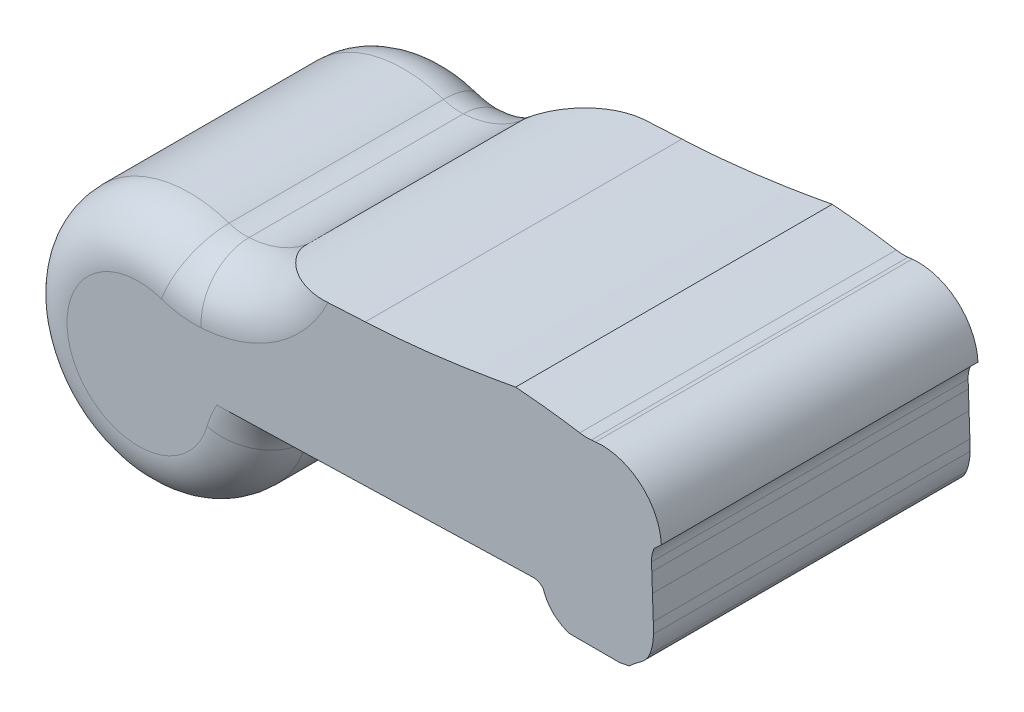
ISO-10303-21;
HEADER;
FILE_DESCRIPTION(('STEP AP214'),'2;1');
FILE_NAME('part.step','',(''),(''),'','','');
FILE_SCHEMA(('AUTOMOTIVE_DESIGN { 1 0 10303 214 1 1 1 1 }'));
ENDSEC;
DATA;
#1=APPLICATION_CONTEXT('core data for automotive mechanical design processes');
#2=APPLICATION_PROTOCOL_DEFINITION('international standard','automotive_design',2000,#1);
#3=PRODUCT_CONTEXT('',#1,'mechanical');
#4=PRODUCT('Part','Part','',(#3));
#5=PRODUCT_RELATED_PRODUCT_CATEGORY('part','',(#4));
#6=PRODUCT_DEFINITION_FORMATION('','',#4);
#7=PRODUCT_DEFINITION_CONTEXT('part definition',#1,'design');
#8=PRODUCT_DEFINITION('design','',#6,#7);
#9=PRODUCT_DEFINITION_SHAPE('','',#8);
#10=(LENGTH_UNIT() NAMED_UNIT(*) SI_UNIT(.MILLI.,.METRE.));
#11=(NAMED_UNIT(*) PLANE_ANGLE_UNIT() SI_UNIT($,.RADIAN.));
#12=(NAMED_UNIT(*) SI_UNIT($,.STERADIAN.) SOLID_ANGLE_UNIT());
#13=UNCERTAINTY_MEASURE_WITH_UNIT(LENGTH_MEASURE(1.E-05),#10,'distance_accuracy_value','');
#14=(GEOMETRIC_REPRESENTATION_CONTEXT(3) GLOBAL_UNCERTAINTY_ASSIGNED_CONTEXT((#13)) GLOBAL_UNIT_ASSIGNED_CONTEXT((#10,
#11,#12)) REPRESENTATION_CONTEXT('',''));
#15=CARTESIAN_POINT('',(0.,0.,0.));
#16=DIRECTION('',(0.,0.,1.));
#17=DIRECTION('',(1.,0.,0.));
#18=AXIS2_PLACEMENT_3D('',#15,#16,#17);
#19=CARTESIAN_POINT('',(3.95578667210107E-13,0.,-228.22));
#20=DIRECTION('',(0.,0.,-1.));
#21=DIRECTION('',(-1.,0.,0.));
#22=AXIS2_PLACEMENT_3D('',#19,#20,#21);
#23=PLANE('',#22);
#24=CARTESIAN_POINT('',(41.7933695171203,122.460772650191,-228.22));
#25=DIRECTION('',(0.,0.,-1.));
#26=DIRECTION('',(-1.,0.,0.));
#27=AXIS2_PLACEMENT_3D('',#24,#25,#26);
#28=CIRCLE('',#27,76.2);
#29=CARTESIAN_POINT('',(46.7292629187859,46.420803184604,-228.22));
#30=VERTEX_POINT('',#29);
#31=CARTESIAN_POINT('',(17.181676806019,50.3448619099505,-228.22));
#32=VERTEX_POINT('',#31);
#33=EDGE_CURVE('E985',#30,#32,#28,.T.);
#34=ORIENTED_EDGE('',*,*,#33,.F.);
#35=CARTESIAN_POINT('',(39.3921671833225,159.452526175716,-228.22));
#36=DIRECTION('',(0.,0.,-1.));
#37=DIRECTION('',(-1.,0.,0.));
#38=AXIS2_PLACEMENT_3D('',#35,#36,#37);
#39=CIRCLE('',#38,113.269604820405);
#40=CARTESIAN_POINT('',(141.308460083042,110.025078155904,-228.22));
#41=VERTEX_POINT('',#40);
#42=EDGE_CURVE('E977',#30,#41,#39,.F.);
#43=ORIENTED_EDGE('',*,*,#42,.T.);
#44=CARTESIAN_POINT('',(168.999999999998,111.505100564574,-228.22));
#45=CARTESIAN_POINT('',(164.503080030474,111.328943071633,-228.22));
#46=CARTESIAN_POINT('',(160.030257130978,111.124565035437,-228.22));
#47=CARTESIAN_POINT('',(153.357764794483,110.773931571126,-228.22));
#48=CARTESIAN_POINT('',(151.139756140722,110.649621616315,-228.22));
#49=CARTESIAN_POINT('',(146.716567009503,110.384717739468,-228.22));
#50=CARTESIAN_POINT('',(144.517441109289,110.244474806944,-228.22));
#51=CARTESIAN_POINT('',(140.15375208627,109.947106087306,-228.22));
#52=CARTESIAN_POINT('',(137.987079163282,109.789844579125,-228.22));
#53=CARTESIAN_POINT('',(133.690771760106,109.455891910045,-228.22));
#54=CARTESIAN_POINT('',(131.5674665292,109.279697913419,-228.22));
#55=CARTESIAN_POINT('',(127.37373063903,108.905874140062,-228.22));
#56=CARTESIAN_POINT('',(125.300614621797,108.707966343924,-228.22));
#57=CARTESIAN_POINT('',(121.224863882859,108.288214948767,-228.22));
#58=CARTESIAN_POINT('',(119.225647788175,108.066754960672,-228.22));
#59=CARTESIAN_POINT('',(116.290027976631,107.714487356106,-228.22));
#60=CARTESIAN_POINT('',(115.322043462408,107.59371497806,-228.22));
#61=CARTESIAN_POINT('',(113.40836188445,107.344992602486,-228.22));
#62=CARTESIAN_POINT('',(112.462553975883,107.217010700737,-228.22));
#63=CARTESIAN_POINT('',(109.67347612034,106.823477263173,-228.22));
#64=CARTESIAN_POINT('',(107.874033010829,106.54773250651,-228.22));
#65=CARTESIAN_POINT('',(104.408724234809,105.968141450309,-228.22));
#66=CARTESIAN_POINT('',(102.738610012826,105.663269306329,-228.22));
#67=CARTESIAN_POINT('',(99.587790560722,105.034352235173,-228.22));
#68=CARTESIAN_POINT('',(98.1035843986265,104.709724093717,-228.22));
#69=CARTESIAN_POINT('',(96.0333822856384,104.215558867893,-228.22));
#70=CARTESIAN_POINT('',(95.3727913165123,104.050488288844,-228.22));
#71=CARTESIAN_POINT('',(94.1191275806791,103.723722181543,-228.22));
#72=CARTESIAN_POINT('',(93.5250810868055,103.561790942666,-228.22));
#73=CARTESIAN_POINT('',(91.8461777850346,103.08556634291,-228.22));
#74=CARTESIAN_POINT('',(90.863806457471,102.780207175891,-228.22));
#75=CARTESIAN_POINT('',(89.6259166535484,102.371182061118,-228.22));
#76=CARTESIAN_POINT('',(89.251490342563,102.242707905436,-228.22));
#77=CARTESIAN_POINT('',(88.599783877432,102.013269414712,-228.22));
#78=CARTESIAN_POINT('',(88.3211012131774,101.91190255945,-228.22));
#79=CARTESIAN_POINT('',(87.6294516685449,101.65593492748,-228.22));
#80=CARTESIAN_POINT('',(87.3601570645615,101.550117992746,-228.22));
#81=CARTESIAN_POINT('',(87.2982421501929,101.526042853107,-228.22));
#82=B_SPLINE_CURVE_WITH_KNOTS('',3,(#44,#45,#46,#47,#48,#49,#50,#51,#52,#53,#54,#55,#56,#57,#58,
#59,#60,#61,#62,#63,#64,#65,#66,#67,#68,#69,#70,#71,#72,#73,#74,#75,#76,#77,#78,#79,#80,#81),
.UNSPECIFIED.,.F.,.F.,(4,2,2,2,2,2,2,2,2,2,2,2,2,2,2,2,2,2,4),(0.,0.125,0.1875,0.25,0.3125,
0.375,0.4375,0.5,0.53125,0.5625,0.625,0.6875,0.749999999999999,0.781249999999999,
0.812499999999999,0.875,0.90625,0.9375,1.),.UNSPECIFIED.);
#83=CARTESIAN_POINT('',(168.999999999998,111.505100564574,-228.22));
#84=VERTEX_POINT('',#83);
#85=EDGE_CURVE('E270',#84,#41,#82,.T.);
#86=ORIENTED_EDGE('',*,*,#85,.F.);
#87=CARTESIAN_POINT('',(280.981486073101,125.410202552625,-228.22));
#88=CARTESIAN_POINT('',(280.955195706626,125.405335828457,-228.22));
#89=CARTESIAN_POINT('',(280.901017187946,125.395306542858,-228.22));
#90=CARTESIAN_POINT('',(280.737980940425,125.36514478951,-228.22));
#91=CARTESIAN_POINT('',(280.628849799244,125.344961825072,-228.22));
#92=CARTESIAN_POINT('',(280.222487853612,125.269878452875,-228.22));
#93=CARTESIAN_POINT('',(279.85000100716,125.201124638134,-228.22));
#94=CARTESIAN_POINT('',(278.926400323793,125.031201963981,-228.22));
#95=CARTESIAN_POINT('',(278.375194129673,124.930017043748,-228.22));
#96=CARTESIAN_POINT('',(277.427450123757,124.756794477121,-228.22));
#97=CARTESIAN_POINT('',(277.090066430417,124.695241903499,-228.22));
#98=CARTESIAN_POINT('',(276.385399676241,124.566977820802,-228.22));
#99=CARTESIAN_POINT('',(276.017791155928,124.500205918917,-228.22));
#100=CARTESIAN_POINT('',(274.110565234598,124.154649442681,-228.22));
#101=CARTESIAN_POINT('',(272.366706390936,123.84137795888,-228.22));
#102=CARTESIAN_POINT('',(269.512176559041,123.335963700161,-228.22));
#103=CARTESIAN_POINT('',(268.520225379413,123.161455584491,-228.22));
#104=CARTESIAN_POINT('',(266.464527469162,122.802636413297,-228.22));
#105=CARTESIAN_POINT('',(265.39794266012,122.617839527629,-228.22));
#106=CARTESIAN_POINT('',(262.124054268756,122.055549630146,-228.22));
#107=CARTESIAN_POINT('',(259.846625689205,121.670815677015,-228.22));
#108=CARTESIAN_POINT('',(256.317937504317,121.087188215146,-228.22));
#109=CARTESIAN_POINT('',(255.121443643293,120.891312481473,-228.22));
#110=CARTESIAN_POINT('',(252.70275878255,120.499832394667,-228.22));
#111=CARTESIAN_POINT('',(251.480192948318,120.304160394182,-228.22));
#112=CARTESIAN_POINT('',(247.776455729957,119.718607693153,-228.22));
#113=CARTESIAN_POINT('',(245.259421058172,119.330220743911,-228.22));
#114=CARTESIAN_POINT('',(241.422291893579,118.754884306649,-228.22));
#115=CARTESIAN_POINT('',(240.131947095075,118.564161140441,-228.22));
#116=CARTESIAN_POINT('',(237.537147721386,118.186507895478,-228.22));
#117=CARTESIAN_POINT('',(236.233113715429,117.999633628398,-228.22));
#118=CARTESIAN_POINT('',(229.68181957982,117.076227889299,-228.22));
#119=CARTESIAN_POINT('',(224.342264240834,116.372778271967,-228.22));
#120=CARTESIAN_POINT('',(216.208808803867,115.390877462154,-228.22));
#121=CARTESIAN_POINT('',(213.478479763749,115.075997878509,-228.22));
#122=CARTESIAN_POINT('',(208.000369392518,114.475886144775,-228.22));
#123=CARTESIAN_POINT('',(205.249874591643,114.190320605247,-228.22));
#124=CARTESIAN_POINT('',(199.726936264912,113.650448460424,-228.22));
#125=CARTESIAN_POINT('',(196.954489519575,113.396141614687,-228.22));
#126=CARTESIAN_POINT('',(191.388154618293,112.920930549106,-228.22));
#127=CARTESIAN_POINT('',(188.597935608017,112.700359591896,-228.22));
#128=CARTESIAN_POINT('',(180.219352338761,112.093104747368,-228.22));
#129=CARTESIAN_POINT('',(174.617704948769,111.760498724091,-228.22));
#130=CARTESIAN_POINT('',(168.999999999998,111.505100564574,-228.22));
#131=B_SPLINE_CURVE_WITH_KNOTS('',3,(#87,#88,#89,#90,#91,#92,#93,#94,#95,#96,#97,#98,#99,#100,
#101,#102,#103,#104,#105,#106,#107,#108,#109,#110,#111,#112,#113,#114,#115,#116,#117,#118,#119,
#120,#121,#122,#123,#124,#125,#126,#127,#128,#129,#130),.UNSPECIFIED.,.F.,.F.,(4,2,2,2,2,2,2,2,
2,2,2,2,2,2,2,2,2,2,2,2,2,4),(0.,0.0156250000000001,0.0312500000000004,0.0625000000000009,
0.0937500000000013,0.109375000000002,0.125000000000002,0.187500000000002,0.218750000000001,
0.250000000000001,0.3125,0.34375,0.375,0.437499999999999,0.468749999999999,0.499999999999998,
0.624999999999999,0.687499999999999,0.749999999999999,0.812499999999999,0.875,1.),.UNSPECIFIED.);
#132=CARTESIAN_POINT('',(280.981486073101,125.410202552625,-228.22));
#133=VERTEX_POINT('',#132);
#134=EDGE_CURVE('E277',#133,#84,#131,.T.);
#135=ORIENTED_EDGE('',*,*,#134,.F.);
#136=CARTESIAN_POINT('',(328.685624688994,119.753296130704,-228.22));
#137=CARTESIAN_POINT('',(320.752692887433,121.072712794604,-228.22));
#138=CARTESIAN_POINT('',(312.808913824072,122.162088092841,-228.22));
#139=CARTESIAN_POINT('',(296.906017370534,124.015553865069,-228.22));
#140=CARTESIAN_POINT('',(288.946810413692,124.777744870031,-228.22));
#141=CARTESIAN_POINT('',(280.981486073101,125.410202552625,-228.22));
#142=B_SPLINE_CURVE_WITH_KNOTS('',3,(#136,#137,#138,#139,#140,#141),.UNSPECIFIED.,.F.,.F.,(4,2,
4),(0.,0.5,1.),.UNSPECIFIED.);
#143=CARTESIAN_POINT('',(328.685624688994,119.753296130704,-228.22));
#144=VERTEX_POINT('',#143);
#145=EDGE_CURVE('E286',#144,#133,#142,.T.);
#146=ORIENTED_EDGE('',*,*,#145,.F.);
#147=CARTESIAN_POINT('',(337.404947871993,119.486933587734,-228.22));
#148=CARTESIAN_POINT('',(335.945685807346,119.333558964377,-228.22));
#149=CARTESIAN_POINT('',(334.489504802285,119.281042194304,-228.22));
#150=CARTESIAN_POINT('',(331.583085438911,119.370539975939,-228.22));
#151=CARTESIAN_POINT('',(330.132848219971,119.51259182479,-228.22));
#152=CARTESIAN_POINT('',(328.685624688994,119.753296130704,-228.22));
#153=B_SPLINE_CURVE_WITH_KNOTS('',3,(#147,#148,#149,#150,#151,#152),.UNSPECIFIED.,.F.,.F.,(4,2,
4),(0.,0.5,1.),.UNSPECIFIED.);
#154=CARTESIAN_POINT('',(337.404947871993,119.486933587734,-228.219999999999));
#155=VERTEX_POINT('',#154);
#156=EDGE_CURVE('E295',#155,#144,#153,.T.);
#157=ORIENTED_EDGE('',*,*,#156,.F.);
#158=DIRECTION('',(-0.994521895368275,-0.104528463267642,0.));
#159=VECTOR('',#158,1.);
#160=CARTESIAN_POINT('',(337.404947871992,119.486933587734,-228.219999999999));
#161=LINE('',#160,#159);
#162=CARTESIAN_POINT('',(340.494335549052,119.811641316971,-228.22));
#163=VERTEX_POINT('',#162);
#164=EDGE_CURVE('E304',#163,#155,#161,.T.);
#165=ORIENTED_EDGE('',*,*,#164,.F.);
#166=CARTESIAN_POINT('',(345.024099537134,75.4610767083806,-228.22));
#167=DIRECTION('',(0.,0.,1.));
#168=DIRECTION('',(0.656059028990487,0.75470958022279,0.));
#169=AXIS2_PLACEMENT_3D('',#166,#167,#168);
#170=ELLIPSE('',#169,44.6512533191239,44.5199999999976);
#171=CARTESIAN_POINT('',(389.542596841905,77.865896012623,-228.219999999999));
#172=VERTEX_POINT('',#171);
#173=EDGE_CURVE('E311',#172,#163,#170,.T.);
#174=ORIENTED_EDGE('',*,*,#173,.F.);
#175=DIRECTION('',(0.73875791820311,0.673970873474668,0.));
#176=VECTOR('',#175,1.);
#177=CARTESIAN_POINT('',(384.060461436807,72.8645288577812,-228.219999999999));
#178=LINE('',#177,#176);
#179=CARTESIAN_POINT('',(384.060461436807,72.8645288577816,-228.22));
#180=VERTEX_POINT('',#179);
#181=EDGE_CURVE('E315',#180,#172,#178,.T.);
#182=ORIENTED_EDGE('',*,*,#181,.F.);
#183=CARTESIAN_POINT('',(382.184587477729,63.250000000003,-228.22));
#184=CARTESIAN_POINT('',(382.167903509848,63.7277663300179,-228.22));
#185=CARTESIAN_POINT('',(382.167413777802,64.2027953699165,-228.22));
#186=CARTESIAN_POINT('',(382.197724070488,65.1474593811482,-228.22));
#187=CARTESIAN_POINT('',(382.228880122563,65.6190449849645,-228.22));
#188=CARTESIAN_POINT('',(382.363302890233,66.9911078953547,-228.22));
#189=CARTESIAN_POINT('',(382.507080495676,67.8602268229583,-228.22));
#190=CARTESIAN_POINT('',(382.781939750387,69.100955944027,-228.22));
#191=CARTESIAN_POINT('',(382.884117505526,69.5057364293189,-228.22));
#192=CARTESIAN_POINT('',(383.09908909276,70.273526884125,-228.22));
#193=CARTESIAN_POINT('',(383.212330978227,70.6390564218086,-228.22));
#194=CARTESIAN_POINT('',(383.446267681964,71.3353976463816,-228.22));
#195=CARTESIAN_POINT('',(383.566973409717,71.6662035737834,-228.22));
#196=CARTESIAN_POINT('',(383.812362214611,72.2933887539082,-228.22));
#197=CARTESIAN_POINT('',(383.93762936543,72.5908890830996,-228.22));
#198=CARTESIAN_POINT('',(384.060461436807,72.8645288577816,-228.22));
#199=B_SPLINE_CURVE_WITH_KNOTS('',3,(#183,#184,#185,#186,#187,#188,#189,#190,#191,#192,#193,
#194,#195,#196,#197,#198),.UNSPECIFIED.,.F.,.F.,(4,2,2,2,2,2,2,4),(0.,0.125,0.25,
0.499999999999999,0.624999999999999,0.749999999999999,0.875,1.),.UNSPECIFIED.);
#200=CARTESIAN_POINT('',(382.184587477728,63.2499999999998,-228.219999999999));
#201=VERTEX_POINT('',#200);
#202=EDGE_CURVE('E319',#201,#180,#199,.T.);
#203=ORIENTED_EDGE('',*,*,#202,.F.);
#204=DIRECTION('',(-0.034899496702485,0.999390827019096,0.));
#205=VECTOR('',#204,1.);
#206=CARTESIAN_POINT('',(382.403898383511,56.9697573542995,-228.219999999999));
#207=LINE('',#206,#205);
#208=CARTESIAN_POINT('',(382.403898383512,56.9697573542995,-228.22));
#209=VERTEX_POINT('',#208);
#210=EDGE_CURVE('E325',#209,#201,#207,.T.);
#211=ORIENTED_EDGE('',*,*,#210,.F.);
#212=CARTESIAN_POINT('',(382.882434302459,43.2662815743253,-228.22));
#213=CARTESIAN_POINT('',(382.842554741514,44.4082827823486,-228.22));
#214=CARTESIAN_POINT('',(382.809463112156,45.5504837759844,-228.22));
#215=CARTESIAN_POINT('',(382.747391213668,47.8350067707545,-228.22));
#216=CARTESIAN_POINT('',(382.718682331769,48.977336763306,-228.22));
#217=CARTESIAN_POINT('',(382.642777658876,51.2614526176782,-228.22));
#218=CARTESIAN_POINT('',(382.592621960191,52.4030173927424,-228.22));
#219=CARTESIAN_POINT('',(382.492353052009,54.6861486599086,-228.22));
#220=CARTESIAN_POINT('',(382.443777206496,55.8277772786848,-228.22));
#221=CARTESIAN_POINT('',(382.403898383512,56.9697573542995,-228.22));
#222=B_SPLINE_CURVE_WITH_KNOTS('',3,(#212,#213,#214,#215,#216,#217,#218,#219,#220,#221),
.UNSPECIFIED.,.F.,.F.,(4,2,2,2,4),(0.,0.25,0.5,0.75,1.),.UNSPECIFIED.);
#223=CARTESIAN_POINT('',(382.882434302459,43.2662815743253,-228.219999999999));
#224=VERTEX_POINT('',#223);
#225=EDGE_CURVE('E332',#224,#209,#222,.T.);
#226=ORIENTED_EDGE('',*,*,#225,.F.);
#227=DIRECTION('',(-0.0348994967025,0.999390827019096,0.));
#228=VECTOR('',#227,1.);
#229=CARTESIAN_POINT('',(383.507766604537,25.3591073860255,-228.219999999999));
#230=LINE('',#229,#228);
#231=CARTESIAN_POINT('',(383.507766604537,25.3591073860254,-228.22));
#232=VERTEX_POINT('',#231);
#233=EDGE_CURVE('E338',#232,#224,#230,.T.);
#234=ORIENTED_EDGE('',*,*,#233,.F.);
#235=CARTESIAN_POINT('',(383.63610391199,17.3842894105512,-228.22));
#236=CARTESIAN_POINT('',(383.644507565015,20.0433857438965,-228.22));
#237=CARTESIAN_POINT('',(383.600567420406,22.7016397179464,-228.22));
#238=CARTESIAN_POINT('',(383.507766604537,25.3591073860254,-228.22));
#239=B_SPLINE_CURVE_WITH_KNOTS('',3,(#235,#236,#237,#238),.UNSPECIFIED.,.F.,.F.,(4,4),(0.,1.),.UNSPECIFIED.);
#240=CARTESIAN_POINT('',(383.63610391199,17.3842894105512,-228.22));
#241=VERTEX_POINT('',#240);
#242=EDGE_CURVE('E345',#241,#232,#239,.T.);
#243=ORIENTED_EDGE('',*,*,#242,.F.);
#244=CARTESIAN_POINT('',(380.83926825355,2.93998050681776,-228.22));
#245=CARTESIAN_POINT('',(381.76401159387,5.25856632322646,-228.22));
#246=CARTESIAN_POINT('',(382.453233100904,7.62275597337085,-228.22));
#247=CARTESIAN_POINT('',(383.385336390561,12.4375595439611,-228.22));
#248=CARTESIAN_POINT('',(383.628215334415,14.8881740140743,-228.22));
#249=CARTESIAN_POINT('',(383.63610391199,17.3842894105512,-228.22));
#250=B_SPLINE_CURVE_WITH_KNOTS('',3,(#244,#245,#246,#247,#248,#249),.UNSPECIFIED.,.F.,.F.,(4,2,
4),(0.,0.5,1.),.UNSPECIFIED.);
#251=CARTESIAN_POINT('',(380.83926825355,2.93998050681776,-228.22));
#252=VERTEX_POINT('',#251);
#253=EDGE_CURVE('E351',#252,#241,#250,.T.);
#254=ORIENTED_EDGE('',*,*,#253,.F.);
#255=CARTESIAN_POINT('',(378.210387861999,-1.4436469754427,-228.22));
#256=CARTESIAN_POINT('',(378.479754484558,-1.12053454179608,-228.22));
#257=CARTESIAN_POINT('',(378.739410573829,-0.784652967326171,-228.22));
#258=CARTESIAN_POINT('',(379.233115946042,-0.0928538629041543,-228.22));
#259=CARTESIAN_POINT('',(379.466801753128,0.262361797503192,-228.22));
#260=CARTESIAN_POINT('',(380.127352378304,1.35719682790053,-228.22));
#261=CARTESIAN_POINT('',(380.514416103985,2.12548684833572,-228.22));
#262=CARTESIAN_POINT('',(380.83926825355,2.93998050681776,-228.22));
#263=B_SPLINE_CURVE_WITH_KNOTS('',3,(#255,#256,#257,#258,#259,#260,#261,#262),.UNSPECIFIED.,.F.,
.F.,(4,2,2,4),(0.,0.250000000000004,0.500000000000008,1.),.UNSPECIFIED.);
#264=CARTESIAN_POINT('',(378.210387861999,-1.4436469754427,-228.219999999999));
#265=VERTEX_POINT('',#264);
#266=EDGE_CURVE('E360',#265,#252,#263,.T.);
#267=ORIENTED_EDGE('',*,*,#266,.F.);
#268=DIRECTION('',(0.667293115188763,0.744795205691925,0.));
#269=VECTOR('',#268,1.);
#270=CARTESIAN_POINT('',(377.376998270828,-2.37382976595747,-228.219999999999));
#271=LINE('',#270,#269);
#272=CARTESIAN_POINT('',(377.376998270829,-2.37382976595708,-228.22));
#273=VERTEX_POINT('',#272);
#274=EDGE_CURVE('E369',#273,#265,#271,.T.);
#275=ORIENTED_EDGE('',*,*,#274,.F.);
#276=CARTESIAN_POINT('',(373.729897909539,-5.57648603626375,-228.22));
#277=CARTESIAN_POINT('',(375.000350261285,-4.65565975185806,-228.22));
#278=CARTESIAN_POINT('',(376.207594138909,-3.58948436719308,-228.22));
#279=CARTESIAN_POINT('',(377.376998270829,-2.37382976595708,-228.22));
#280=B_SPLINE_CURVE_WITH_KNOTS('',3,(#276,#277,#278,#279),.UNSPECIFIED.,.F.,.F.,(4,4),(0.,1.),.UNSPECIFIED.);
#281=CARTESIAN_POINT('',(373.729897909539,-5.57648603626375,-228.22));
#282=VERTEX_POINT('',#281);
#283=EDGE_CURVE('E376',#282,#273,#280,.T.);
#284=ORIENTED_EDGE('',*,*,#283,.F.);
#285=CARTESIAN_POINT('',(365.553898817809,-12.1892772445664,-228.22));
#286=CARTESIAN_POINT('',(366.825644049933,-10.9474403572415,-228.22));
#287=CARTESIAN_POINT('',(368.175684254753,-9.80463881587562,-228.22));
#288=CARTESIAN_POINT('',(370.930060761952,-7.62432449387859,-228.22));
#289=CARTESIAN_POINT('',(372.334993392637,-6.5875154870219,-228.22));
#290=CARTESIAN_POINT('',(373.729897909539,-5.57648603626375,-228.22));
#291=B_SPLINE_CURVE_WITH_KNOTS('',3,(#285,#286,#287,#288,#289,#290),.UNSPECIFIED.,.F.,.F.,(4,2,
4),(0.,0.5,1.),.UNSPECIFIED.);
#292=CARTESIAN_POINT('',(365.553898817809,-12.1892772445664,-228.219999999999));
#293=VERTEX_POINT('',#292);
#294=EDGE_CURVE('E382',#293,#282,#291,.T.);
#295=ORIENTED_EDGE('',*,*,#294,.F.);
#296=DIRECTION('',(0.981521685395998,0.191350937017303,0.));
#297=VECTOR('',#296,1.);
#298=CARTESIAN_POINT('',(358.443956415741,-13.5753843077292,-228.219999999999));
#299=LINE('',#298,#297);
#300=CARTESIAN_POINT('',(358.443956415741,-13.5753843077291,-228.219999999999));
#301=VERTEX_POINT('',#300);
#302=EDGE_CURVE('E391',#301,#293,#299,.T.);
#303=ORIENTED_EDGE('',*,*,#302,.F.);
#304=DIRECTION('',(1.,0.,0.));
#305=VECTOR('',#304,1.);
#306=CARTESIAN_POINT('',(358.443956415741,-13.5753843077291,-228.219999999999));
#307=LINE('',#306,#305);
#308=CARTESIAN_POINT('',(321.328529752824,-13.5753843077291,-228.219999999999));
#309=VERTEX_POINT('',#308);
#310=EDGE_CURVE('E398',#309,#301,#307,.T.);
#311=ORIENTED_EDGE('',*,*,#310,.F.);
#312=CARTESIAN_POINT('',(329.342499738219,14.5419943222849,-228.219999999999));
#313=DIRECTION('',(0.,0.,-1.));
#314=DIRECTION('',(-1.,0.,0.));
#315=AXIS2_PLACEMENT_3D('',#312,#313,#314);
#316=CIRCLE('',#315,29.237145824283);
#317=CARTESIAN_POINT('',(301.430425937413,5.83987779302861,-228.219999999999));
#318=VERTEX_POINT('',#317);
#319=EDGE_CURVE('E245',#318,#309,#316,.F.);
#320=ORIENTED_EDGE('',*,*,#319,.F.);
#321=CARTESIAN_POINT('',(293.955092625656,-0.802365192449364,-228.219999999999));
#322=DIRECTION('',(0.,0.,-1.));
#323=DIRECTION('',(-1.,0.,0.));
#324=AXIS2_PLACEMENT_3D('',#321,#322,#323);
#325=CIRCLE('',#324,10.);
#326=CARTESIAN_POINT('',(293.955092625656,9.19763480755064,-228.219999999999));
#327=VERTEX_POINT('',#326);
#328=EDGE_CURVE('E239',#327,#318,#325,.T.);
#329=ORIENTED_EDGE('',*,*,#328,.F.);
#330=DIRECTION('',(0.999605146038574,0.0280989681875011,0.));
#331=VECTOR('',#330,1.);
#332=CARTESIAN_POINT('',(125.287839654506,4.45638693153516,-228.219999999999));
#333=LINE('',#332,#331);
#334=CARTESIAN_POINT('',(58.4119430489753,2.57650095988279,-228.22));
#335=VERTEX_POINT('',#334);
#336=EDGE_CURVE('E242',#335,#327,#333,.T.);
#337=ORIENTED_EDGE('',*,*,#336,.F.);
#338=CARTESIAN_POINT('',(127.275643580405,-36.6457969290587,-228.219999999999));
#339=DIRECTION('',(0.,0.,-1.));
#340=DIRECTION('',(-1.,0.,0.));
#341=AXIS2_PLACEMENT_3D('',#338,#339,#340);
#342=CIRCLE('',#341,79.2502233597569);
#343=CARTESIAN_POINT('',(51.1192805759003,-14.7185016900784,-228.22));
#344=VERTEX_POINT('',#343);
#345=EDGE_CURVE('E979',#335,#344,#342,.F.);
#346=ORIENTED_EDGE('',*,*,#345,.T.);
#347=CARTESIAN_POINT('',(-1.26000697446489E-13,0.,-228.22));
#348=DIRECTION('',(0.,0.,-1.));
#349=DIRECTION('',(-1.,0.,0.));
#350=AXIS2_PLACEMENT_3D('',#347,#348,#349);
#351=CIRCLE('',#350,53.1960067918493);
#352=EDGE_CURVE('E981',#344,#32,#351,.T.);
#353=ORIENTED_EDGE('',*,*,#352,.T.);
#354=EDGE_LOOP('',(#34,#43,#86,#135,#146,#157,#165,#174,#182,#203,#211,#226,#234,#243,#254,#267,
#275,#284,#295,#303,#311,#320,#329,#337,#346,#353));
#355=FACE_BOUND('',#354,.T.);
#356=ADVANCED_FACE('F34',(#355),#23,.T.);
#357=CARTESIAN_POINT('',(-1.92040252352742E-13,0.,7.62));
#358=DIRECTION('',(0.,0.,1.));
#359=DIRECTION('',(1.,0.,0.));
#360=AXIS2_PLACEMENT_3D('',#357,#358,#359);
#361=PLANE('',#360);
#362=CARTESIAN_POINT('',(127.275643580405,-36.6457969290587,7.62));
#363=DIRECTION('',(0.,0.,1.));
#364=DIRECTION('',(1.,0.,0.));
#365=AXIS2_PLACEMENT_3D('',#362,#363,#364);
#366=CIRCLE('',#365,79.2502233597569);
#367=CARTESIAN_POINT('',(51.1192805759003,-14.7185016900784,7.62));
#368=VERTEX_POINT('',#367);
#369=CARTESIAN_POINT('',(58.4119430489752,2.5765009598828,7.62));
#370=VERTEX_POINT('',#369);
#371=EDGE_CURVE('E972',#368,#370,#366,.F.);
#372=ORIENTED_EDGE('',*,*,#371,.T.);
#373=DIRECTION('',(0.999605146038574,0.0280989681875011,0.));
#374=VECTOR('',#373,1.);
#375=CARTESIAN_POINT('',(125.287839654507,4.45638693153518,7.62));
#376=LINE('',#375,#374);
#377=CARTESIAN_POINT('',(293.955092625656,9.19763480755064,7.62));
#378=VERTEX_POINT('',#377);
#379=EDGE_CURVE('E268',#370,#378,#376,.T.);
#380=ORIENTED_EDGE('',*,*,#379,.T.);
#381=CARTESIAN_POINT('',(293.955092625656,-0.802365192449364,7.62));
#382=DIRECTION('',(0.,0.,-1.));
#383=DIRECTION('',(1.,0.,0.));
#384=AXIS2_PLACEMENT_3D('',#381,#382,#383);
#385=CIRCLE('',#384,10.);
#386=CARTESIAN_POINT('',(301.430425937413,5.8398777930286,7.62));
#387=VERTEX_POINT('',#386);
#388=EDGE_CURVE('E254',#378,#387,#385,.T.);
#389=ORIENTED_EDGE('',*,*,#388,.T.);
#390=CARTESIAN_POINT('',(329.342499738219,14.5419943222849,7.62));
#391=DIRECTION('',(0.,0.,1.));
#392=DIRECTION('',(1.,0.,0.));
#393=AXIS2_PLACEMENT_3D('',#390,#391,#392);
#394=CIRCLE('',#393,29.237145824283);
#395=CARTESIAN_POINT('',(321.328529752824,-13.5753843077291,7.62));
#396=VERTEX_POINT('',#395);
#397=EDGE_CURVE('E639',#387,#396,#394,.T.);
#398=ORIENTED_EDGE('',*,*,#397,.T.);
#399=DIRECTION('',(1.,0.,0.));
#400=VECTOR('',#399,1.);
#401=CARTESIAN_POINT('',(358.443956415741,-13.5753843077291,7.62));
#402=LINE('',#401,#400);
#403=CARTESIAN_POINT('',(358.443956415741,-13.5753843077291,7.62));
#404=VERTEX_POINT('',#403);
#405=EDGE_CURVE('E638',#396,#404,#402,.T.);
#406=ORIENTED_EDGE('',*,*,#405,.T.);
#407=DIRECTION('',(0.981521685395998,0.191350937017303,0.));
#408=VECTOR('',#407,1.);
#409=CARTESIAN_POINT('',(358.443956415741,-13.5753843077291,7.62));
#410=LINE('',#409,#408);
#411=CARTESIAN_POINT('',(365.553898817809,-12.1892772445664,7.62));
#412=VERTEX_POINT('',#411);
#413=EDGE_CURVE('E633',#404,#412,#410,.T.);
#414=ORIENTED_EDGE('',*,*,#413,.T.);
#415=CARTESIAN_POINT('',(373.729897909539,-5.57648603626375,7.61999999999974));
#416=CARTESIAN_POINT('',(372.334993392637,-6.5875154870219,7.61999999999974));
#417=CARTESIAN_POINT('',(370.930060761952,-7.62432449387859,7.61999999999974));
#418=CARTESIAN_POINT('',(368.175684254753,-9.80463881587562,7.61999999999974));
#419=CARTESIAN_POINT('',(366.825644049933,-10.9474403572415,7.61999999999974));
#420=CARTESIAN_POINT('',(365.553898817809,-12.1892772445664,7.61999999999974));
#421=B_SPLINE_CURVE_WITH_KNOTS('',3,(#415,#416,#417,#418,#419,#420),.UNSPECIFIED.,.F.,.F.,(4,2,
4),(0.,0.5,1.),.UNSPECIFIED.);
#422=CARTESIAN_POINT('',(373.729897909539,-5.57648603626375,7.62));
#423=VERTEX_POINT('',#422);
#424=EDGE_CURVE('E627',#412,#423,#421,.F.);
#425=ORIENTED_EDGE('',*,*,#424,.T.);
#426=CARTESIAN_POINT('',(377.376998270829,-2.37382976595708,7.61999999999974));
#427=CARTESIAN_POINT('',(376.207594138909,-3.58948436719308,7.61999999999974));
#428=CARTESIAN_POINT('',(375.000350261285,-4.65565975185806,7.61999999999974));
#429=CARTESIAN_POINT('',(373.729897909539,-5.57648603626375,7.61999999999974));
#430=B_SPLINE_CURVE_WITH_KNOTS('',3,(#426,#427,#428,#429),.UNSPECIFIED.,.F.,.F.,(4,4),(0.,1.),.UNSPECIFIED.);
#431=CARTESIAN_POINT('',(377.376998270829,-2.37382976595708,7.62));
#432=VERTEX_POINT('',#431);
#433=EDGE_CURVE('E630',#423,#432,#430,.F.);
#434=ORIENTED_EDGE('',*,*,#433,.T.);
#435=DIRECTION('',(0.667293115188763,0.744795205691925,0.));
#436=VECTOR('',#435,1.);
#437=CARTESIAN_POINT('',(377.376998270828,-2.37382976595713,7.62));
#438=LINE('',#437,#436);
#439=CARTESIAN_POINT('',(378.210387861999,-1.4436469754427,7.62));
#440=VERTEX_POINT('',#439);
#441=EDGE_CURVE('E637',#432,#440,#438,.T.);
#442=ORIENTED_EDGE('',*,*,#441,.T.);
#443=CARTESIAN_POINT('',(380.83926825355,2.93998050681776,7.61999999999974));
#444=CARTESIAN_POINT('',(380.514416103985,2.12548684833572,7.61999999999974));
#445=CARTESIAN_POINT('',(380.127352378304,1.35719682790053,7.61999999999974));
#446=CARTESIAN_POINT('',(379.466801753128,0.262361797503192,7.61999999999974));
#447=CARTESIAN_POINT('',(379.233115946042,-0.0928538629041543,7.61999999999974));
#448=CARTESIAN_POINT('',(378.739410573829,-0.784652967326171,7.61999999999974));
#449=CARTESIAN_POINT('',(378.479754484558,-1.12053454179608,7.61999999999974));
#450=CARTESIAN_POINT('',(378.210387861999,-1.4436469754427,7.61999999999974));
#451=B_SPLINE_CURVE_WITH_KNOTS('',3,(#443,#444,#445,#446,#447,#448,#449,#450),.UNSPECIFIED.,.F.,
.F.,(4,2,2,4),(0.,0.499999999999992,0.749999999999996,1.),.UNSPECIFIED.);
#452=CARTESIAN_POINT('',(380.83926825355,2.93998050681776,7.62));
#453=VERTEX_POINT('',#452);
#454=EDGE_CURVE('E1159',#440,#453,#451,.F.);
#455=ORIENTED_EDGE('',*,*,#454,.T.);
#456=CARTESIAN_POINT('',(383.63610391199,17.3842894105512,7.61999999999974));
#457=CARTESIAN_POINT('',(383.628215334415,14.8881740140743,7.61999999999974));
#458=CARTESIAN_POINT('',(383.385336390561,12.4375595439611,7.61999999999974));
#459=CARTESIAN_POINT('',(382.453233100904,7.62275597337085,7.61999999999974));
#460=CARTESIAN_POINT('',(381.76401159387,5.25856632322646,7.61999999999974));
#461=CARTESIAN_POINT('',(380.83926825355,2.93998050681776,7.61999999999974));
#462=B_SPLINE_CURVE_WITH_KNOTS('',3,(#456,#457,#458,#459,#460,#461),.UNSPECIFIED.,.F.,.F.,(4,2,
4),(0.,0.5,1.),.UNSPECIFIED.);
#463=CARTESIAN_POINT('',(383.63610391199,17.3842894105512,7.62));
#464=VERTEX_POINT('',#463);
#465=EDGE_CURVE('E1107',#453,#464,#462,.F.);
#466=ORIENTED_EDGE('',*,*,#465,.T.);
#467=CARTESIAN_POINT('',(383.507766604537,25.3591073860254,7.61999999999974));
#468=CARTESIAN_POINT('',(383.600567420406,22.7016397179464,7.61999999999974));
#469=CARTESIAN_POINT('',(383.644507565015,20.0433857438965,7.61999999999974));
#470=CARTESIAN_POINT('',(383.63610391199,17.3842894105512,7.61999999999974));
#471=B_SPLINE_CURVE_WITH_KNOTS('',3,(#467,#468,#469,#470),.UNSPECIFIED.,.F.,.F.,(4,4),(0.,1.),.UNSPECIFIED.);
#472=CARTESIAN_POINT('',(383.507766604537,25.3591073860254,7.62));
#473=VERTEX_POINT('',#472);
#474=EDGE_CURVE('E1103',#464,#473,#471,.F.);
#475=ORIENTED_EDGE('',*,*,#474,.T.);
#476=DIRECTION('',(-0.0348994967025,0.999390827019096,0.));
#477=VECTOR('',#476,1.);
#478=CARTESIAN_POINT('',(383.507766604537,25.3591073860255,7.62));
#479=LINE('',#478,#477);
#480=CARTESIAN_POINT('',(382.882434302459,43.2662815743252,7.62));
#481=VERTEX_POINT('',#480);
#482=EDGE_CURVE('E1102',#473,#481,#479,.T.);
#483=ORIENTED_EDGE('',*,*,#482,.T.);
#484=CARTESIAN_POINT('',(382.403898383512,56.9697573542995,7.61999999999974));
#485=CARTESIAN_POINT('',(382.443777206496,55.8277772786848,7.61999999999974));
#486=CARTESIAN_POINT('',(382.492353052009,54.6861486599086,7.61999999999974));
#487=CARTESIAN_POINT('',(382.592621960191,52.4030173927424,7.61999999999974));
#488=CARTESIAN_POINT('',(382.642777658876,51.2614526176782,7.61999999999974));
#489=CARTESIAN_POINT('',(382.718682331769,48.977336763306,7.61999999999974));
#490=CARTESIAN_POINT('',(382.747391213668,47.8350067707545,7.61999999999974));
#491=CARTESIAN_POINT('',(382.809463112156,45.5504837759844,7.61999999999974));
#492=CARTESIAN_POINT('',(382.842554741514,44.4082827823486,7.61999999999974));
#493=CARTESIAN_POINT('',(382.882434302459,43.2662815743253,7.61999999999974));
#494=B_SPLINE_CURVE_WITH_KNOTS('',3,(#484,#485,#486,#487,#488,#489,#490,#491,#492,#493),
.UNSPECIFIED.,.F.,.F.,(4,2,2,2,4),(0.,0.25,0.5,0.75,1.),.UNSPECIFIED.);
#495=CARTESIAN_POINT('',(382.403898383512,56.9697573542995,7.62));
#496=VERTEX_POINT('',#495);
#497=EDGE_CURVE('E1100',#481,#496,#494,.F.);
#498=ORIENTED_EDGE('',*,*,#497,.T.);
#499=DIRECTION('',(-0.034899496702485,0.999390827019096,0.));
#500=VECTOR('',#499,1.);
#501=CARTESIAN_POINT('',(382.403898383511,56.9697573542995,7.62));
#502=LINE('',#501,#500);
#503=CARTESIAN_POINT('',(382.184587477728,63.2499999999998,7.62));
#504=VERTEX_POINT('',#503);
#505=EDGE_CURVE('E1081',#496,#504,#502,.T.);
#506=ORIENTED_EDGE('',*,*,#505,.T.);
#507=CARTESIAN_POINT('',(384.060461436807,72.8645288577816,7.61999999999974));
#508=CARTESIAN_POINT('',(383.93762936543,72.5908890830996,7.61999999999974));
#509=CARTESIAN_POINT('',(383.812362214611,72.2933887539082,7.61999999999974));
#510=CARTESIAN_POINT('',(383.566973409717,71.6662035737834,7.61999999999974));
#511=CARTESIAN_POINT('',(383.446267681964,71.3353976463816,7.61999999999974));
#512=CARTESIAN_POINT('',(383.212330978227,70.6390564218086,7.61999999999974));
#513=CARTESIAN_POINT('',(383.09908909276,70.273526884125,7.61999999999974));
#514=CARTESIAN_POINT('',(382.884117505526,69.5057364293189,7.61999999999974));
#515=CARTESIAN_POINT('',(382.781939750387,69.100955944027,7.61999999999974));
#516=CARTESIAN_POINT('',(382.507080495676,67.8602268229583,7.61999999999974));
#517=CARTESIAN_POINT('',(382.363302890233,66.9911078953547,7.61999999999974));
#518=CARTESIAN_POINT('',(382.228880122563,65.6190449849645,7.61999999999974));
#519=CARTESIAN_POINT('',(382.197724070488,65.1474593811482,7.61999999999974));
#520=CARTESIAN_POINT('',(382.167413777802,64.2027953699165,7.61999999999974));
#521=CARTESIAN_POINT('',(382.167903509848,63.7277663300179,7.61999999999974));
#522=CARTESIAN_POINT('',(382.184587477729,63.250000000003,7.61999999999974));
#523=B_SPLINE_CURVE_WITH_KNOTS('',3,(#507,#508,#509,#510,#511,#512,#513,#514,#515,#516,#517,
#518,#519,#520,#521,#522),.UNSPECIFIED.,.F.,.F.,(4,2,2,2,2,2,2,4),(0.,0.125,0.250000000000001,
0.375000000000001,0.500000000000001,0.75,0.875,1.),.UNSPECIFIED.);
#524=CARTESIAN_POINT('',(384.060461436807,72.8645288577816,7.62));
#525=VERTEX_POINT('',#524);
#526=EDGE_CURVE('E1091',#504,#525,#523,.F.);
#527=ORIENTED_EDGE('',*,*,#526,.T.);
#528=DIRECTION('',(0.73875791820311,0.673970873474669,0.));
#529=VECTOR('',#528,1.);
#530=CARTESIAN_POINT('',(384.060461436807,72.8645288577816,7.62));
#531=LINE('',#530,#529);
#532=CARTESIAN_POINT('',(389.542596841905,77.865896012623,7.62));
#533=VERTEX_POINT('',#532);
#534=EDGE_CURVE('E1031',#525,#533,#531,.T.);
#535=ORIENTED_EDGE('',*,*,#534,.T.);
#536=CARTESIAN_POINT('',(345.024099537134,75.4610767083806,7.62));
#537=DIRECTION('',(0.,0.,1.));
#538=DIRECTION('',(0.656059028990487,0.75470958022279,0.));
#539=AXIS2_PLACEMENT_3D('',#536,#537,#538);
#540=ELLIPSE('',#539,44.6512533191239,44.5199999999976);
#541=CARTESIAN_POINT('',(340.494335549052,119.811641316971,7.62));
#542=VERTEX_POINT('',#541);
#543=EDGE_CURVE('E1028',#533,#542,#540,.T.);
#544=ORIENTED_EDGE('',*,*,#543,.T.);
#545=DIRECTION('',(-0.994521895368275,-0.104528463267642,0.));
#546=VECTOR('',#545,1.);
#547=CARTESIAN_POINT('',(337.404947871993,119.486933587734,7.62));
#548=LINE('',#547,#546);
#549=CARTESIAN_POINT('',(337.404947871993,119.486933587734,7.62));
#550=VERTEX_POINT('',#549);
#551=EDGE_CURVE('E1030',#542,#550,#548,.T.);
#552=ORIENTED_EDGE('',*,*,#551,.T.);
#553=CARTESIAN_POINT('',(328.685624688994,119.753296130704,7.61999999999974));
#554=CARTESIAN_POINT('',(330.132848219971,119.51259182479,7.61999999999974));
#555=CARTESIAN_POINT('',(331.583085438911,119.370539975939,7.61999999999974));
#556=CARTESIAN_POINT('',(334.489504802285,119.281042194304,7.61999999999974));
#557=CARTESIAN_POINT('',(335.945685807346,119.333558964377,7.61999999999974));
#558=CARTESIAN_POINT('',(337.404947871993,119.486933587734,7.61999999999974));
#559=B_SPLINE_CURVE_WITH_KNOTS('',3,(#553,#554,#555,#556,#557,#558),.UNSPECIFIED.,.F.,.F.,(4,2,
4),(0.,0.5,1.),.UNSPECIFIED.);
#560=CARTESIAN_POINT('',(328.685624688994,119.753296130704,7.62));
#561=VERTEX_POINT('',#560);
#562=EDGE_CURVE('E1039',#550,#561,#559,.F.);
#563=ORIENTED_EDGE('',*,*,#562,.T.);
#564=CARTESIAN_POINT('',(280.981486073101,125.410202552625,7.61999999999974));
#565=CARTESIAN_POINT('',(288.946810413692,124.777744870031,7.61999999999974));
#566=CARTESIAN_POINT('',(296.906017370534,124.015553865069,7.61999999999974));
#567=CARTESIAN_POINT('',(312.808913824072,122.162088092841,7.61999999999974));
#568=CARTESIAN_POINT('',(320.752692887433,121.072712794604,7.61999999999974));
#569=CARTESIAN_POINT('',(328.685624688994,119.753296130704,7.61999999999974));
#570=B_SPLINE_CURVE_WITH_KNOTS('',3,(#564,#565,#566,#567,#568,#569),.UNSPECIFIED.,.F.,.F.,(4,2,
4),(0.,0.5,1.),.UNSPECIFIED.);
#571=CARTESIAN_POINT('',(280.981486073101,125.410202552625,7.62));
#572=VERTEX_POINT('',#571);
#573=EDGE_CURVE('E1037',#561,#572,#570,.F.);
#574=ORIENTED_EDGE('',*,*,#573,.T.);
#575=CARTESIAN_POINT('',(168.999999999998,111.505100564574,7.61999999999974));
#576=CARTESIAN_POINT('',(174.617704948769,111.760498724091,7.61999999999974));
#577=CARTESIAN_POINT('',(180.219352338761,112.093104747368,7.61999999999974));
#578=CARTESIAN_POINT('',(188.597935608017,112.700359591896,7.61999999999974));
#579=CARTESIAN_POINT('',(191.388154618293,112.920930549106,7.61999999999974));
#580=CARTESIAN_POINT('',(196.954489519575,113.396141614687,7.61999999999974));
#581=CARTESIAN_POINT('',(199.726936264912,113.650448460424,7.61999999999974));
#582=CARTESIAN_POINT('',(205.249874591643,114.190320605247,7.61999999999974));
#583=CARTESIAN_POINT('',(208.000369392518,114.475886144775,7.61999999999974));
#584=CARTESIAN_POINT('',(213.478479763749,115.075997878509,7.61999999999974));
#585=CARTESIAN_POINT('',(216.208808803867,115.390877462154,7.61999999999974));
#586=CARTESIAN_POINT('',(224.342264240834,116.372778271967,7.61999999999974));
#587=CARTESIAN_POINT('',(229.68181957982,117.076227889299,7.61999999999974));
#588=CARTESIAN_POINT('',(236.233113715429,117.999633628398,7.61999999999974));
#589=CARTESIAN_POINT('',(237.537147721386,118.186507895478,7.61999999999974));
#590=CARTESIAN_POINT('',(240.131947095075,118.564161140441,7.61999999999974));
#591=CARTESIAN_POINT('',(241.422291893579,118.754884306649,7.61999999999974));
#592=CARTESIAN_POINT('',(245.259421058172,119.330220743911,7.61999999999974));
#593=CARTESIAN_POINT('',(247.776455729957,119.718607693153,7.61999999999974));
#594=CARTESIAN_POINT('',(251.480192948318,120.304160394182,7.61999999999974));
#595=CARTESIAN_POINT('',(252.70275878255,120.499832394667,7.61999999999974));
#596=CARTESIAN_POINT('',(255.121443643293,120.891312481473,7.61999999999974));
#597=CARTESIAN_POINT('',(256.317937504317,121.087188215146,7.61999999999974));
#598=CARTESIAN_POINT('',(259.846625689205,121.670815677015,7.61999999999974));
#599=CARTESIAN_POINT('',(262.124054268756,122.055549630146,7.61999999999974));
#600=CARTESIAN_POINT('',(265.39794266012,122.617839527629,7.61999999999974));
#601=CARTESIAN_POINT('',(266.464527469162,122.802636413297,7.61999999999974));
#602=CARTESIAN_POINT('',(268.520225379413,123.161455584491,7.61999999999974));
#603=CARTESIAN_POINT('',(269.512176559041,123.335963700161,7.61999999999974));
#604=CARTESIAN_POINT('',(272.366706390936,123.84137795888,7.61999999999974));
#605=CARTESIAN_POINT('',(274.110565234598,124.154649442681,7.61999999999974));
#606=CARTESIAN_POINT('',(276.017791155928,124.500205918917,7.61999999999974));
#607=CARTESIAN_POINT('',(276.385399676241,124.566977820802,7.61999999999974));
#608=CARTESIAN_POINT('',(277.090066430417,124.695241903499,7.61999999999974));
#609=CARTESIAN_POINT('',(277.427450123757,124.756794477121,7.61999999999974));
#610=CARTESIAN_POINT('',(278.375194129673,124.930017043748,7.61999999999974));
#611=CARTESIAN_POINT('',(278.926400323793,125.031201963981,7.61999999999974));
#612=CARTESIAN_POINT('',(279.85000100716,125.201124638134,7.61999999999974));
#613=CARTESIAN_POINT('',(280.222487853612,125.269878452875,7.61999999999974));
#614=CARTESIAN_POINT('',(280.628849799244,125.344961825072,7.61999999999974));
#615=CARTESIAN_POINT('',(280.737980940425,125.36514478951,7.61999999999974));
#616=CARTESIAN_POINT('',(280.901017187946,125.395306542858,7.61999999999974));
#617=CARTESIAN_POINT('',(280.955195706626,125.405335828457,7.61999999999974));
#618=CARTESIAN_POINT('',(280.981486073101,125.410202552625,7.61999999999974));
#619=B_SPLINE_CURVE_WITH_KNOTS('',3,(#575,#576,#577,#578,#579,#580,#581,#582,#583,#584,#585,
#586,#587,#588,#589,#590,#591,#592,#593,#594,#595,#596,#597,#598,#599,#600,#601,#602,#603,#604,
#605,#606,#607,#608,#609,#610,#611,#612,#613,#614,#615,#616,#617,#618),.UNSPECIFIED.,.F.,.F.,(4,
2,2,2,2,2,2,2,2,2,2,2,2,2,2,2,2,2,2,2,2,4),(0.,0.125,0.187500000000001,0.250000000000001,
0.312500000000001,0.375000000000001,0.500000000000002,0.531250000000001,0.562500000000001,0.625,
0.65625,0.6875,0.749999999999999,0.781249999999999,0.812499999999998,0.874999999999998,
0.890624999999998,0.906249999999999,0.937499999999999,0.96875,0.984375,1.),.UNSPECIFIED.);
#620=CARTESIAN_POINT('',(168.999999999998,111.505100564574,7.62));
#621=VERTEX_POINT('',#620);
#622=EDGE_CURVE('E265',#572,#621,#619,.F.);
#623=ORIENTED_EDGE('',*,*,#622,.T.);
#624=CARTESIAN_POINT('',(141.30845972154,110.025078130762,7.61999999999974));
#625=CARTESIAN_POINT('',(141.650455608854,110.048863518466,7.61999999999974));
#626=CARTESIAN_POINT('',(141.992838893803,110.072432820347,7.61999999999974));
#627=CARTESIAN_POINT('',(144.517441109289,110.244474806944,7.61999999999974));
#628=CARTESIAN_POINT('',(146.716567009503,110.384717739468,7.61999999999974));
#629=CARTESIAN_POINT('',(151.139756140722,110.649621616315,7.61999999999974));
#630=CARTESIAN_POINT('',(153.357764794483,110.773931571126,7.61999999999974));
#631=CARTESIAN_POINT('',(160.030257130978,111.124565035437,7.61999999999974));
#632=CARTESIAN_POINT('',(164.503080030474,111.328943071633,7.61999999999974));
#633=CARTESIAN_POINT('',(168.999999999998,111.505100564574,7.61999999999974));
#634=B_SPLINE_CURVE_WITH_KNOTS('',3,(#624,#625,#626,#627,#628,#629,#630,#631,#632,#633),
.UNSPECIFIED.,.F.,.F.,(4,2,2,2,4),(0.,0.00981846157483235,0.0723184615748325,0.134818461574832,
0.259818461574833),.UNSPECIFIED.);
#635=CARTESIAN_POINT('',(141.308459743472,110.025077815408,7.61999999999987));
#636=VERTEX_POINT('',#635);
#637=EDGE_CURVE('E262',#621,#636,#634,.F.);
#638=ORIENTED_EDGE('',*,*,#637,.T.);
#639=CARTESIAN_POINT('',(39.3921671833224,159.452526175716,7.62));
#640=DIRECTION('',(0.,0.,1.));
#641=DIRECTION('',(1.,0.,0.));
#642=AXIS2_PLACEMENT_3D('',#639,#640,#641);
#643=CIRCLE('',#642,113.269604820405);
#644=CARTESIAN_POINT('',(46.7292629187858,46.420803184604,7.62));
#645=VERTEX_POINT('',#644);
#646=EDGE_CURVE('E965',#636,#645,#643,.F.);
#647=ORIENTED_EDGE('',*,*,#646,.T.);
#648=CARTESIAN_POINT('',(41.7933695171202,122.460772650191,7.62));
#649=DIRECTION('',(0.,0.,1.));
#650=DIRECTION('',(1.,0.,0.));
#651=AXIS2_PLACEMENT_3D('',#648,#649,#650);
#652=CIRCLE('',#651,76.2);
#653=CARTESIAN_POINT('',(17.1816768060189,50.3448619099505,7.62));
#654=VERTEX_POINT('',#653);
#655=EDGE_CURVE('E969',#654,#645,#652,.T.);
#656=ORIENTED_EDGE('',*,*,#655,.F.);
#657=CARTESIAN_POINT('',(-1.92040252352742E-13,0.,7.62));
#658=DIRECTION('',(0.,0.,1.));
#659=DIRECTION('',(1.,0.,0.));
#660=AXIS2_PLACEMENT_3D('',#657,#658,#659);
#661=CIRCLE('',#660,53.1960067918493);
#662=EDGE_CURVE('E973',#654,#368,#661,.T.);
#663=ORIENTED_EDGE('',*,*,#662,.T.);
#664=EDGE_LOOP('',(#372,#380,#389,#398,#406,#414,#425,#434,#442,#455,#466,#475,#483,#498,#506,
#527,#535,#544,#552,#563,#574,#623,#638,#647,#656,#663));
#665=FACE_BOUND('',#664,.T.);
#666=ADVANCED_FACE('F480',(#665),#361,.T.);
#667=CARTESIAN_POINT('',(-1.92040252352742E-13,0.,-486.444101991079));
#668=DIRECTION('',(0.,0.,1.));
#669=DIRECTION('',(1.,0.,0.));
#670=AXIS2_PLACEMENT_3D('',#667,#668,#669);
#671=CYLINDRICAL_SURFACE('',#670,91.2960067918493);
#672=DIRECTION('',(0.,0.,1.));
#673=VECTOR('',#672,1.);
#674=CARTESIAN_POINT('',(29.4875231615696,86.4028172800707,-486.444101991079));
#675=LINE('',#674,#673);
#676=CARTESIAN_POINT('',(29.4875231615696,86.4028172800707,-30.48));
#677=VERTEX_POINT('',#676);
#678=CARTESIAN_POINT('',(29.4875231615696,86.4028172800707,-190.12));
#679=VERTEX_POINT('',#678);
#680=EDGE_CURVE('E53',#677,#679,#675,.F.);
#681=ORIENTED_EDGE('',*,*,#680,.T.);
#682=CARTESIAN_POINT('',(-1.92040252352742E-13,0.,-190.12));
#683=DIRECTION('',(0.,0.,-1.));
#684=DIRECTION('',(-1.,0.,0.));
#685=AXIS2_PLACEMENT_3D('',#682,#683,#684);
#686=CIRCLE('',#685,91.2960067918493);
#687=CARTESIAN_POINT('',(87.7318894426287,-25.2601748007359,-190.12));
#688=VERTEX_POINT('',#687);
#689=EDGE_CURVE('E957',#679,#688,#686,.F.);
#690=ORIENTED_EDGE('',*,*,#689,.T.);
#691=DIRECTION('',(0.,0.,1.));
#692=VECTOR('',#691,1.);
#693=CARTESIAN_POINT('',(87.7318894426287,-25.2601748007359,-613.686443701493));
#694=LINE('',#693,#692);
#695=CARTESIAN_POINT('',(87.7318894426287,-25.2601748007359,-30.4800000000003));
#696=VERTEX_POINT('',#695);
#697=EDGE_CURVE('E403',#688,#696,#694,.T.);
#698=ORIENTED_EDGE('',*,*,#697,.T.);
#699=CARTESIAN_POINT('',(-1.92040252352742E-13,0.,-30.48));
#700=DIRECTION('',(0.,0.,1.));
#701=DIRECTION('',(1.,0.,0.));
#702=AXIS2_PLACEMENT_3D('',#699,#700,#701);
#703=CIRCLE('',#702,91.2960067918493);
#704=EDGE_CURVE('E58',#696,#677,#703,.F.);
#705=ORIENTED_EDGE('',*,*,#704,.T.);
#706=EDGE_LOOP('',(#681,#690,#698,#705));
#707=FACE_BOUND('',#706,.T.);
#708=ADVANCED_FACE('F484',(#707),#671,.T.);
#709=CARTESIAN_POINT('',(125.287839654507,4.45638693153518,-613.686443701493));
#710=DIRECTION('',(0.0280989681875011,-0.999605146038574,0.));
#711=DIRECTION('',(0.999605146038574,0.0280989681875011,0.));
#712=AXIS2_PLACEMENT_3D('',#709,#710,#711);
#713=PLANE('',#712);
#714=DIRECTION('',(0.,0.,1.));
#715=VECTOR('',#714,1.);
#716=CARTESIAN_POINT('',(125.287839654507,4.45638693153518,-613.686443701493));
#717=LINE('',#716,#715);
#718=CARTESIAN_POINT('',(125.287839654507,4.45638693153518,-190.12));
#719=VERTEX_POINT('',#718);
#720=CARTESIAN_POINT('',(125.287839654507,4.45638693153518,-30.4800000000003));
#721=VERTEX_POINT('',#720);
#722=EDGE_CURVE('E405',#719,#721,#717,.T.);
#723=ORIENTED_EDGE('',*,*,#722,.F.);
#724=CARTESIAN_POINT('',(125.287839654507,4.45638693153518,-190.119999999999));
#725=CARTESIAN_POINT('',(125.288186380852,4.45639667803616,-190.177460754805));
#726=CARTESIAN_POINT('',(125.2814229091,4.45620655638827,-190.234253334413));
#727=CARTESIAN_POINT('',(125.25750798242,4.45553430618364,-190.344200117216));
#728=CARTESIAN_POINT('',(125.240624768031,4.45505971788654,-190.397410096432));
#729=CARTESIAN_POINT('',(125.175818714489,4.45323801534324,-190.562340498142));
#730=CARTESIAN_POINT('',(125.114844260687,4.4515240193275,-190.668507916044));
#731=CARTESIAN_POINT('',(124.979681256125,4.44772457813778,-190.874412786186));
#732=CARTESIAN_POINT('',(124.905217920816,4.44563140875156,-190.973942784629));
#733=CARTESIAN_POINT('',(124.741976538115,4.44104268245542,-191.179206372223));
#734=CARTESIAN_POINT('',(124.652525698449,4.4385282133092,-191.284411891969));
#735=CARTESIAN_POINT('',(124.470146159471,4.43340151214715,-191.491781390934));
#736=CARTESIAN_POINT('',(124.377215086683,4.43078921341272,-191.593943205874));
#737=CARTESIAN_POINT('',(124.095316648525,4.42286502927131,-191.898041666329));
#738=CARTESIAN_POINT('',(123.903479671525,4.41747247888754,-192.097317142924));
#739=CARTESIAN_POINT('',(123.518837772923,4.40666016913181,-192.490741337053));
#740=CARTESIAN_POINT('',(123.326064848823,4.40124130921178,-192.68492204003));
#741=CARTESIAN_POINT('',(122.938974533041,4.39036017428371,-193.071417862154));
#742=CARTESIAN_POINT('',(122.744658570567,4.38489793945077,-193.263734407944));
#743=CARTESIAN_POINT('',(122.160606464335,4.36848019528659,-193.838685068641));
#744=CARTESIAN_POINT('',(121.769335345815,4.3574815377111,-194.219753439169));
#745=CARTESIAN_POINT('',(120.984443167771,4.33541816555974,-194.979472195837));
#746=CARTESIAN_POINT('',(120.590822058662,4.32435344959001,-195.358122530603));
#747=CARTESIAN_POINT('',(119.801498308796,4.30216550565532,-196.11351893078));
#748=CARTESIAN_POINT('',(119.405794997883,4.29104225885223,-196.49026429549));
#749=CARTESIAN_POINT('',(118.612524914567,4.26874338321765,-197.24177903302));
#750=CARTESIAN_POINT('',(118.214958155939,4.2575677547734,-197.616548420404));
#751=CARTESIAN_POINT('',(117.015743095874,4.22385773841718,-198.741140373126));
#752=CARTESIAN_POINT('',(116.211149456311,4.20124055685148,-199.487828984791));
#753=CARTESIAN_POINT('',(114.59290860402,4.1557516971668,-200.971254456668));
#754=CARTESIAN_POINT('',(113.779261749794,4.13288002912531,-201.707991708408));
#755=CARTESIAN_POINT('',(111.887462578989,4.07970142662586,-203.396031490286));
#756=CARTESIAN_POINT('',(110.805484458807,4.04928694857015,-204.343069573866));
#757=CARTESIAN_POINT('',(108.619761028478,3.98784611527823,-206.211602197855));
#758=CARTESIAN_POINT('',(107.516015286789,3.95681974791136,-207.133096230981));
#759=CARTESIAN_POINT('',(104.166048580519,3.8626519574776,-209.85193467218));
#760=CARTESIAN_POINT('',(101.88155186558,3.79843460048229,-211.60322340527));
#761=CARTESIAN_POINT('',(98.3661169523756,3.69961548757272,-214.09903302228));
#762=CARTESIAN_POINT('',(97.1809080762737,3.66629918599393,-214.90827784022));
#763=CARTESIAN_POINT('',(94.7783376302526,3.59876276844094,-216.477373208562));
#764=CARTESIAN_POINT('',(93.5609805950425,3.56454277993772,-217.237230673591));
#765=CARTESIAN_POINT('',(91.0935733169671,3.49518379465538,-218.700316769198));
#766=CARTESIAN_POINT('',(89.8435424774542,3.46004534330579,-219.403578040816));
#767=CARTESIAN_POINT('',(87.3100161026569,3.38882774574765,-220.74662070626));
#768=CARTESIAN_POINT('',(86.0265256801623,3.35274874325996,-221.386411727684));
#769=CARTESIAN_POINT('',(83.1268198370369,3.27123781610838,-222.734427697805));
#770=CARTESIAN_POINT('',(81.5020812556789,3.22556630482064,-223.424453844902));
#771=CARTESIAN_POINT('',(78.2054451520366,3.13289764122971,-224.68282747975));
#772=CARTESIAN_POINT('',(76.5335421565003,3.08590033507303,-225.251160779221));
#773=CARTESIAN_POINT('',(73.9979021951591,3.01462332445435,-226.000479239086));
#774=CARTESIAN_POINT('',(73.1491074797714,2.99076364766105,-226.232834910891));
#775=CARTESIAN_POINT('',(71.4425628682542,2.9427925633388,-226.661760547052));
#776=CARTESIAN_POINT('',(70.584813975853,2.91868118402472,-226.85833447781));
#777=CARTESIAN_POINT('',(68.8620116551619,2.87025309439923,-227.213824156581));
#778=CARTESIAN_POINT('',(67.9969621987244,2.84593649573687,-227.372759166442));
#779=CARTESIAN_POINT('',(66.2606585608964,2.79712888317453,-227.651339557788));
#780=CARTESIAN_POINT('',(65.3894054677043,2.77263789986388,-227.770991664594));
#781=CARTESIAN_POINT('',(64.0093983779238,2.73384580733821,-227.92767144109));
#782=CARTESIAN_POINT('',(63.5021526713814,2.71958709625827,-227.978291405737));
#783=CARTESIAN_POINT('',(62.4865353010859,2.69103802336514,-228.065447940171));
#784=CARTESIAN_POINT('',(61.9781638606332,2.67674766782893,-228.101987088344));
#785=CARTESIAN_POINT('',(60.9604193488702,2.64813880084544,-228.160696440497));
#786=CARTESIAN_POINT('',(60.4510459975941,2.63382028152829,-228.18286179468));
#787=CARTESIAN_POINT('',(59.4317661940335,2.60516825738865,-228.212516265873));
#788=CARTESIAN_POINT('',(58.9218596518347,2.59083475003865,-228.220002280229));
#789=CARTESIAN_POINT('',(58.4119430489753,2.5765009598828,-228.22));
#790=B_SPLINE_CURVE_WITH_KNOTS('',3,(#724,#725,#726,#727,#728,#729,#730,#731,#732,#733,#734,
#735,#736,#737,#738,#739,#740,#741,#742,#743,#744,#745,#746,#747,#748,#749,#750,#751,#752,#753,
#754,#755,#756,#757,#758,#759,#760,#761,#762,#763,#764,#765,#766,#767,#768,#769,#770,#771,#772,
#773,#774,#775,#776,#777,#778,#779,#780,#781,#782,#783,#784,#785,#786,#787,#788,#789),
.UNSPECIFIED.,.F.,.F.,(4,2,2,2,2,2,2,2,2,2,2,2,2,2,2,2,2,2,2,2,2,2,2,2,2,2,2,2,2,2,2,2,4),(0.,
0.170941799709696,0.337541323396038,0.701977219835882,1.07490442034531,1.48899943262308,
1.90338218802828,2.73323166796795,3.55425470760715,4.37458991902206,6.01342732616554,
7.65229943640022,9.29173594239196,10.9311603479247,14.2248371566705,17.5183839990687,
21.8326479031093,26.1469974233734,34.7775337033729,39.0831154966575,43.388093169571,
47.6905699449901,51.9923930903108,57.2854172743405,62.5790582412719,65.2194615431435,
67.8595719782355,70.4983283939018,73.1366328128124,74.6663576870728,76.1958023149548,
77.7257627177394,79.2560464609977),.UNSPECIFIED.);
#791=EDGE_CURVE('E46',#719,#335,#790,.T.);
#792=ORIENTED_EDGE('',*,*,#791,.T.);
#793=ORIENTED_EDGE('',*,*,#336,.T.);
#794=DIRECTION('',(0.,0.,1.));
#795=VECTOR('',#794,1.);
#796=CARTESIAN_POINT('',(293.955092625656,9.19763480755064,-613.686443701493));
#797=LINE('',#796,#795);
#798=EDGE_CURVE('E249',#327,#378,#797,.T.);
#799=ORIENTED_EDGE('',*,*,#798,.T.);
#800=ORIENTED_EDGE('',*,*,#379,.F.);
#801=CARTESIAN_POINT('',(58.4119430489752,2.5765009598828,7.62));
#802=CARTESIAN_POINT('',(59.2262408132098,2.5993909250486,7.62001374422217));
#803=CARTESIAN_POINT('',(60.0404758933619,2.62227912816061,7.600915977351));
#804=CARTESIAN_POINT('',(61.667104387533,2.66800376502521,7.52572663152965));
#805=CARTESIAN_POINT('',(62.4794980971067,2.69084020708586,7.46964148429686));
#806=CARTESIAN_POINT('',(64.0998530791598,2.73638849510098,7.32181145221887));
#807=CARTESIAN_POINT('',(64.9078190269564,2.75910047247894,7.23011764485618));
#808=CARTESIAN_POINT('',(66.5190936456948,2.80439351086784,7.01238377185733));
#809=CARTESIAN_POINT('',(67.3224021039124,2.82697456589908,6.88634214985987));
#810=CARTESIAN_POINT('',(69.7057597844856,2.89397091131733,6.46184579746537));
#811=CARTESIAN_POINT('',(71.2774591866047,2.93815148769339,6.11529525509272));
#812=CARTESIAN_POINT('',(74.3904046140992,3.02565659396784,5.30376572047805));
#813=CARTESIAN_POINT('',(75.9316359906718,3.06898071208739,4.83873118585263));
#814=CARTESIAN_POINT('',(78.542943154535,3.14238473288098,3.94946419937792));
#815=CARTESIAN_POINT('',(79.6220396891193,3.17271820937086,3.55141525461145));
#816=CARTESIAN_POINT('',(81.7602544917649,3.23282357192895,2.70457031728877));
#817=CARTESIAN_POINT('',(82.8193708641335,3.26259540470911,2.25576953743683));
#818=CARTESIAN_POINT('',(84.9167534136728,3.3215529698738,1.31137488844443));
#819=CARTESIAN_POINT('',(85.9550152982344,3.35073858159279,0.815771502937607));
#820=CARTESIAN_POINT('',(88.0100657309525,3.40850618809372,-0.21825528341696));
#821=CARTESIAN_POINT('',(89.0268517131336,3.4370881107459,-0.756683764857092));
#822=CARTESIAN_POINT('',(92.0532233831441,3.52215962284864,-2.43517356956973));
#823=CARTESIAN_POINT('',(94.0301831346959,3.57773209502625,-3.63448929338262));
#824=CARTESIAN_POINT('',(97.8994377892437,3.68649710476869,-6.16051548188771));
#825=CARTESIAN_POINT('',(99.7917473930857,3.7396900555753,-7.48720369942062));
#826=CARTESIAN_POINT('',(103.408261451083,3.84135051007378,-10.1726997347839));
#827=CARTESIAN_POINT('',(105.136141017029,3.88992132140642,-11.5265897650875));
#828=CARTESIAN_POINT('',(108.530577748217,3.98533916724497,-14.3017087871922));
#829=CARTESIAN_POINT('',(110.197255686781,4.03218959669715,-15.7227909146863));
#830=CARTESIAN_POINT('',(112.882649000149,4.1076761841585,-18.0859935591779));
#831=CARTESIAN_POINT('',(113.91497207,4.13669485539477,-19.0127718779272));
#832=CARTESIAN_POINT('',(115.965788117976,4.19434343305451,-20.8837620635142));
#833=CARTESIAN_POINT('',(116.984264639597,4.22297287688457,-21.8279919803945));
#834=CARTESIAN_POINT('',(118.581205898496,4.26786300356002,-23.3278940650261));
#835=CARTESIAN_POINT('',(119.163786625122,4.28423938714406,-23.8791959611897));
#836=CARTESIAN_POINT('',(120.033956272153,4.30869991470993,-24.7087189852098));
#837=CARTESIAN_POINT('',(120.323069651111,4.31682691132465,-24.9853394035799));
#838=CARTESIAN_POINT('',(120.900168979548,4.3330492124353,-25.5396964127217));
#839=CARTESIAN_POINT('',(121.188155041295,4.34114452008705,-25.8174328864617));
#840=CARTESIAN_POINT('',(121.634594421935,4.35369396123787,-26.2500724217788));
#841=CARTESIAN_POINT('',(121.793514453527,4.35816121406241,-26.4044934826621));
#842=CARTESIAN_POINT('',(122.110900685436,4.36708296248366,-26.7139002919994));
#843=CARTESIAN_POINT('',(122.269366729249,4.37153745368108,-26.8688862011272));
#844=CARTESIAN_POINT('',(122.586694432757,4.38045755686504,-27.1805428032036));
#845=CARTESIAN_POINT('',(122.745551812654,4.38492304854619,-27.3372178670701));
#846=CARTESIAN_POINT('',(123.062169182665,4.39382318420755,-27.6513349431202));
#847=CARTESIAN_POINT('',(123.219930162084,4.3982578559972,-27.8087759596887));
#848=CARTESIAN_POINT('',(123.5351287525,4.40711810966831,-28.1261575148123));
#849=CARTESIAN_POINT('',(123.692556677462,4.41154341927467,-28.2861077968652));
#850=CARTESIAN_POINT('',(124.005418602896,4.42033798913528,-28.6091276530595));
#851=CARTESIAN_POINT('',(124.160842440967,4.42470696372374,-28.7722069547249));
#852=CARTESIAN_POINT('',(124.464841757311,4.43325240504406,-29.1011387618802));
#853=CARTESIAN_POINT('',(124.613478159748,4.43743058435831,-29.2669320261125));
#854=CARTESIAN_POINT('',(124.825134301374,4.44338025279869,-29.5240235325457));
#855=CARTESIAN_POINT('',(124.893591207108,4.44530458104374,-29.6108142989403));
#856=CARTESIAN_POINT('',(125.023321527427,4.44895130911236,-29.7895318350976));
#857=CARTESIAN_POINT('',(125.084617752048,4.45067435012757,-29.8814408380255));
#858=CARTESIAN_POINT('',(125.166482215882,4.45297556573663,-30.0299064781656));
#859=CARTESIAN_POINT('',(125.192792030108,4.45371513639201,-30.0832051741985));
#860=CARTESIAN_POINT('',(125.237436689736,4.4549701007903,-30.1926967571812));
#861=CARTESIAN_POINT('',(125.255843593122,4.45548752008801,-30.2488580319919));
#862=CARTESIAN_POINT('',(125.274729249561,4.45601839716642,-30.3346347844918));
#863=CARTESIAN_POINT('',(125.279566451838,4.45615437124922,-30.3632875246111));
#864=CARTESIAN_POINT('',(125.28615939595,4.45633969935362,-30.4212776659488));
#865=CARTESIAN_POINT('',(125.287878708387,4.45638802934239,-30.4506191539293));
#866=CARTESIAN_POINT('',(125.287839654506,4.45638693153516,-30.4800000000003));
#867=B_SPLINE_CURVE_WITH_KNOTS('',3,(#801,#802,#803,#804,#805,#806,#807,#808,#809,#810,#811,
#812,#813,#814,#815,#816,#817,#818,#819,#820,#821,#822,#823,#824,#825,#826,#827,#828,#829,#830,
#831,#832,#833,#834,#835,#836,#837,#838,#839,#840,#841,#842,#843,#844,#845,#846,#847,#848,#849,
#850,#851,#852,#853,#854,#855,#856,#857,#858,#859,#860,#861,#862,#863,#864,#865,#866),
.UNSPECIFIED.,.F.,.F.,(4,2,2,2,2,2,2,2,2,2,2,2,2,2,2,2,2,2,2,2,2,2,2,2,2,2,2,2,2,2,2,2,4),(0.,
2.44353987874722,4.88665496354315,7.32627848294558,9.7660125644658,14.5907332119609,
19.4177197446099,22.8681615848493,26.318929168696,29.7703999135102,33.2222807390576,
40.154468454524,47.0854475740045,53.6700844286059,60.2409402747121,64.4035928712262,
68.570822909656,70.9775511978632,72.1781912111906,73.378708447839,74.0436078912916,
74.7087141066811,75.378205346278,76.046982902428,76.7203599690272,77.3963614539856,
78.0640025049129,78.3955939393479,78.7260985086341,78.9040881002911,79.0804184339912,
79.1674348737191,79.2554616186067),.UNSPECIFIED.);
#868=EDGE_CURVE('E11',#370,#721,#867,.T.);
#869=ORIENTED_EDGE('',*,*,#868,.T.);
#870=EDGE_LOOP('',(#723,#792,#793,#799,#800,#869));
#871=FACE_BOUND('',#870,.T.);
#872=ADVANCED_FACE('F259',(#871),#713,.T.);
#873=CARTESIAN_POINT('',(293.955092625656,-0.802365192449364,-613.686443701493));
#874=DIRECTION('',(0.,0.,1.));
#875=DIRECTION('',(1.,0.,0.));
#876=AXIS2_PLACEMENT_3D('',#873,#874,#875);
#877=CYLINDRICAL_SURFACE('',#876,10.);
#878=ORIENTED_EDGE('',*,*,#798,.F.);
#879=ORIENTED_EDGE('',*,*,#328,.T.);
#880=DIRECTION('',(0.,0.,1.));
#881=VECTOR('',#880,1.);
#882=CARTESIAN_POINT('',(301.430425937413,5.8398777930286,-613.686443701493));
#883=LINE('',#882,#881);
#884=EDGE_CURVE('E248',#318,#387,#883,.T.);
#885=ORIENTED_EDGE('',*,*,#884,.T.);
#886=ORIENTED_EDGE('',*,*,#388,.F.);
#887=EDGE_LOOP('',(#878,#879,#885,#886));
#888=FACE_BOUND('',#887,.T.);
#889=ADVANCED_FACE('F252',(#888),#877,.F.);
#890=CARTESIAN_POINT('',(329.342499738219,14.5419943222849,-613.686443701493));
#891=DIRECTION('',(0.,0.,1.));
#892=DIRECTION('',(1.,0.,0.));
#893=AXIS2_PLACEMENT_3D('',#890,#891,#892);
#894=CYLINDRICAL_SURFACE('',#893,29.237145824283);
#895=ORIENTED_EDGE('',*,*,#884,.F.);
#896=ORIENTED_EDGE('',*,*,#319,.T.);
#897=DIRECTION('',(0.,0.,1.));
#898=VECTOR('',#897,1.);
#899=CARTESIAN_POINT('',(321.328529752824,-13.5753843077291,-613.686443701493));
#900=LINE('',#899,#898);
#901=EDGE_CURVE('E401',#309,#396,#900,.T.);
#902=ORIENTED_EDGE('',*,*,#901,.T.);
#903=ORIENTED_EDGE('',*,*,#397,.F.);
#904=EDGE_LOOP('',(#895,#896,#902,#903));
#905=FACE_BOUND('',#904,.T.);
#906=ADVANCED_FACE('F666',(#905),#894,.T.);
#907=CARTESIAN_POINT('',(358.443956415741,-13.5753843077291,-613.686443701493));
#908=DIRECTION('',(0.,-1.,0.));
#909=DIRECTION('',(1.,0.,0.));
#910=AXIS2_PLACEMENT_3D('',#907,#908,#909);
#911=PLANE('',#910);
#912=ORIENTED_EDGE('',*,*,#901,.F.);
#913=ORIENTED_EDGE('',*,*,#310,.T.);
#914=DIRECTION('',(0.,0.,1.));
#915=VECTOR('',#914,1.);
#916=CARTESIAN_POINT('',(358.443956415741,-13.5753843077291,-613.686443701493));
#917=LINE('',#916,#915);
#918=EDGE_CURVE('E397',#301,#404,#917,.T.);
#919=ORIENTED_EDGE('',*,*,#918,.T.);
#920=ORIENTED_EDGE('',*,*,#405,.F.);
#921=EDGE_LOOP('',(#912,#913,#919,#920));
#922=FACE_BOUND('',#921,.T.);
#923=ADVANCED_FACE('F662',(#922),#911,.T.);
#924=CARTESIAN_POINT('',(358.443956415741,-13.5753843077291,-613.686443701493));
#925=DIRECTION('',(0.191350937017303,-0.981521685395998,0.));
#926=DIRECTION('',(0.981521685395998,0.191350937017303,0.));
#927=AXIS2_PLACEMENT_3D('',#924,#925,#926);
#928=PLANE('',#927);
#929=ORIENTED_EDGE('',*,*,#918,.F.);
#930=ORIENTED_EDGE('',*,*,#302,.T.);
#931=DIRECTION('',(0.,0.,1.));
#932=VECTOR('',#931,1.);
#933=CARTESIAN_POINT('',(365.553898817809,-12.1892772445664,-613.686443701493));
#934=LINE('',#933,#932);
#935=EDGE_CURVE('E390',#293,#412,#934,.T.);
#936=ORIENTED_EDGE('',*,*,#935,.T.);
#937=ORIENTED_EDGE('',*,*,#413,.F.);
#938=EDGE_LOOP('',(#929,#930,#936,#937));
#939=FACE_BOUND('',#938,.T.);
#940=ADVANCED_FACE('F657',(#939),#928,.T.);
#941=CARTESIAN_POINT('',(365.553898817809,-12.1892772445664,-613.686443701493));
#942=CARTESIAN_POINT('',(366.825644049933,-10.9474403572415,-613.686443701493));
#943=CARTESIAN_POINT('',(368.175684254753,-9.80463881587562,-613.686443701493));
#944=CARTESIAN_POINT('',(370.930060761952,-7.62432449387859,-613.686443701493));
#945=CARTESIAN_POINT('',(372.334993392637,-6.5875154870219,-613.686443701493));
#946=CARTESIAN_POINT('',(373.729897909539,-5.57648603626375,-613.686443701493));
#947=B_SPLINE_CURVE_WITH_KNOTS('',3,(#941,#942,#943,#944,#945,#946),.UNSPECIFIED.,.F.,.F.,(4,2,
4),(0.,0.5,1.),.UNSPECIFIED.);
#948=DIRECTION('',(0.,0.,1.));
#949=VECTOR('',#948,1.);
#950=SURFACE_OF_LINEAR_EXTRUSION('',#947,#949);
#951=ORIENTED_EDGE('',*,*,#935,.F.);
#952=ORIENTED_EDGE('',*,*,#294,.T.);
#953=DIRECTION('',(0.,0.,1.));
#954=VECTOR('',#953,1.);
#955=CARTESIAN_POINT('',(373.729897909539,-5.57648603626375,-613.686443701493));
#956=LINE('',#955,#954);
#957=EDGE_CURVE('E381',#282,#423,#956,.T.);
#958=ORIENTED_EDGE('',*,*,#957,.T.);
#959=ORIENTED_EDGE('',*,*,#424,.F.);
#960=EDGE_LOOP('',(#951,#952,#958,#959));
#961=FACE_BOUND('',#960,.T.);
#962=ADVANCED_FACE('F646',(#961),#950,.T.);
#963=CARTESIAN_POINT('',(373.729897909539,-5.57648603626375,-613.686443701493));
#964=CARTESIAN_POINT('',(375.000350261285,-4.65565975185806,-613.686443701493));
#965=CARTESIAN_POINT('',(376.207594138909,-3.58948436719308,-613.686443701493));
#966=CARTESIAN_POINT('',(377.376998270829,-2.37382976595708,-613.686443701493));
#967=B_SPLINE_CURVE_WITH_KNOTS('',3,(#963,#964,#965,#966),.UNSPECIFIED.,.F.,.F.,(4,4),(0.,1.),.UNSPECIFIED.);
#968=DIRECTION('',(0.,0.,1.));
#969=VECTOR('',#968,1.);
#970=SURFACE_OF_LINEAR_EXTRUSION('',#967,#969);
#971=ORIENTED_EDGE('',*,*,#957,.F.);
#972=ORIENTED_EDGE('',*,*,#283,.T.);
#973=DIRECTION('',(0.,0.,1.));
#974=VECTOR('',#973,1.);
#975=CARTESIAN_POINT('',(377.376998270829,-2.37382976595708,-613.686443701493));
#976=LINE('',#975,#974);
#977=EDGE_CURVE('E375',#273,#432,#976,.T.);
#978=ORIENTED_EDGE('',*,*,#977,.T.);
#979=ORIENTED_EDGE('',*,*,#433,.F.);
#980=EDGE_LOOP('',(#971,#972,#978,#979));
#981=FACE_BOUND('',#980,.T.);
#982=ADVANCED_FACE('F656',(#981),#970,.T.);
#983=CARTESIAN_POINT('',(377.376998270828,-2.37382976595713,-613.686443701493));
#984=DIRECTION('',(0.744795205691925,-0.667293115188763,0.));
#985=DIRECTION('',(0.667293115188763,0.744795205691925,0.));
#986=AXIS2_PLACEMENT_3D('',#983,#984,#985);
#987=PLANE('',#986);
#988=ORIENTED_EDGE('',*,*,#977,.F.);
#989=ORIENTED_EDGE('',*,*,#274,.T.);
#990=DIRECTION('',(0.,0.,1.));
#991=VECTOR('',#990,1.);
#992=CARTESIAN_POINT('',(378.210387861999,-1.4436469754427,-613.686443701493));
#993=LINE('',#992,#991);
#994=EDGE_CURVE('E368',#265,#440,#993,.T.);
#995=ORIENTED_EDGE('',*,*,#994,.T.);
#996=ORIENTED_EDGE('',*,*,#441,.F.);
#997=EDGE_LOOP('',(#988,#989,#995,#996));
#998=FACE_BOUND('',#997,.T.);
#999=ADVANCED_FACE('F771',(#998),#987,.T.);
#1000=CARTESIAN_POINT('',(378.210387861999,-1.4436469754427,-613.686443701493));
#1001=CARTESIAN_POINT('',(378.479754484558,-1.12053454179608,-613.686443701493));
#1002=CARTESIAN_POINT('',(378.739410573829,-0.784652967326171,-613.686443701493));
#1003=CARTESIAN_POINT('',(379.233115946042,-0.0928538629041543,-613.686443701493));
#1004=CARTESIAN_POINT('',(379.466801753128,0.262361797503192,-613.686443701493));
#1005=CARTESIAN_POINT('',(380.127352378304,1.35719682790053,-613.686443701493));
#1006=CARTESIAN_POINT('',(380.514416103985,2.12548684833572,-613.686443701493));
#1007=CARTESIAN_POINT('',(380.83926825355,2.93998050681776,-613.686443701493));
#1008=B_SPLINE_CURVE_WITH_KNOTS('',3,(#1000,#1001,#1002,#1003,#1004,#1005,#1006,#1007),
.UNSPECIFIED.,.F.,.F.,(4,2,2,4),(0.,0.250000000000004,0.500000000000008,1.),.UNSPECIFIED.);
#1009=DIRECTION('',(0.,0.,1.));
#1010=VECTOR('',#1009,1.);
#1011=SURFACE_OF_LINEAR_EXTRUSION('',#1008,#1010);
#1012=ORIENTED_EDGE('',*,*,#994,.F.);
#1013=ORIENTED_EDGE('',*,*,#266,.T.);
#1014=DIRECTION('',(0.,0.,1.));
#1015=VECTOR('',#1014,1.);
#1016=CARTESIAN_POINT('',(380.83926825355,2.93998050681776,-613.686443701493));
#1017=LINE('',#1016,#1015);
#1018=EDGE_CURVE('E359',#252,#453,#1017,.T.);
#1019=ORIENTED_EDGE('',*,*,#1018,.T.);
#1020=ORIENTED_EDGE('',*,*,#454,.F.);
#1021=EDGE_LOOP('',(#1012,#1013,#1019,#1020));
#1022=FACE_BOUND('',#1021,.T.);
#1023=ADVANCED_FACE('F779',(#1022),#1011,.T.);
#1024=CARTESIAN_POINT('',(380.83926825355,2.93998050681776,-613.686443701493));
#1025=CARTESIAN_POINT('',(381.76401159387,5.25856632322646,-613.686443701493));
#1026=CARTESIAN_POINT('',(382.453233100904,7.62275597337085,-613.686443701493));
#1027=CARTESIAN_POINT('',(383.385336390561,12.4375595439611,-613.686443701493));
#1028=CARTESIAN_POINT('',(383.628215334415,14.8881740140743,-613.686443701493));
#1029=CARTESIAN_POINT('',(383.63610391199,17.3842894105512,-613.686443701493));
#1030=B_SPLINE_CURVE_WITH_KNOTS('',3,(#1024,#1025,#1026,#1027,#1028,#1029),.UNSPECIFIED.,.F.,
.F.,(4,2,4),(0.,0.5,1.),.UNSPECIFIED.);
#1031=DIRECTION('',(0.,0.,1.));
#1032=VECTOR('',#1031,1.);
#1033=SURFACE_OF_LINEAR_EXTRUSION('',#1030,#1032);
#1034=ORIENTED_EDGE('',*,*,#1018,.F.);
#1035=ORIENTED_EDGE('',*,*,#253,.T.);
#1036=DIRECTION('',(0.,0.,1.));
#1037=VECTOR('',#1036,1.);
#1038=CARTESIAN_POINT('',(383.63610391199,17.3842894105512,-613.686443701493));
#1039=LINE('',#1038,#1037);
#1040=EDGE_CURVE('E350',#241,#464,#1039,.T.);
#1041=ORIENTED_EDGE('',*,*,#1040,.T.);
#1042=ORIENTED_EDGE('',*,*,#465,.F.);
#1043=EDGE_LOOP('',(#1034,#1035,#1041,#1042));
#1044=FACE_BOUND('',#1043,.T.);
#1045=ADVANCED_FACE('F787',(#1044),#1033,.T.);
#1046=CARTESIAN_POINT('',(383.63610391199,17.3842894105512,-613.686443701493));
#1047=CARTESIAN_POINT('',(383.644507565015,20.0433857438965,-613.686443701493));
#1048=CARTESIAN_POINT('',(383.600567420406,22.7016397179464,-613.686443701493));
#1049=CARTESIAN_POINT('',(383.507766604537,25.3591073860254,-613.686443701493));
#1050=B_SPLINE_CURVE_WITH_KNOTS('',3,(#1046,#1047,#1048,#1049),.UNSPECIFIED.,.F.,.F.,(4,4),(0.,
1.),.UNSPECIFIED.);
#1051=DIRECTION('',(0.,0.,1.));
#1052=VECTOR('',#1051,1.);
#1053=SURFACE_OF_LINEAR_EXTRUSION('',#1050,#1052);
#1054=ORIENTED_EDGE('',*,*,#1040,.F.);
#1055=ORIENTED_EDGE('',*,*,#242,.T.);
#1056=DIRECTION('',(0.,0.,1.));
#1057=VECTOR('',#1056,1.);
#1058=CARTESIAN_POINT('',(383.507766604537,25.3591073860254,-613.686443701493));
#1059=LINE('',#1058,#1057);
#1060=EDGE_CURVE('E344',#232,#473,#1059,.T.);
#1061=ORIENTED_EDGE('',*,*,#1060,.T.);
#1062=ORIENTED_EDGE('',*,*,#474,.F.);
#1063=EDGE_LOOP('',(#1054,#1055,#1061,#1062));
#1064=FACE_BOUND('',#1063,.T.);
#1065=ADVANCED_FACE('F796',(#1064),#1053,.T.);
#1066=CARTESIAN_POINT('',(383.507766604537,25.3591073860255,-613.686443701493));
#1067=DIRECTION('',(0.999390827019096,0.0348994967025,0.));
#1068=DIRECTION('',(-0.0348994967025,0.999390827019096,0.));
#1069=AXIS2_PLACEMENT_3D('',#1066,#1067,#1068);
#1070=PLANE('',#1069);
#1071=ORIENTED_EDGE('',*,*,#1060,.F.);
#1072=ORIENTED_EDGE('',*,*,#233,.T.);
#1073=DIRECTION('',(0.,0.,1.));
#1074=VECTOR('',#1073,1.);
#1075=CARTESIAN_POINT('',(382.882434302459,43.2662815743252,-613.686443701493));
#1076=LINE('',#1075,#1074);
#1077=EDGE_CURVE('E337',#224,#481,#1076,.T.);
#1078=ORIENTED_EDGE('',*,*,#1077,.T.);
#1079=ORIENTED_EDGE('',*,*,#482,.F.);
#1080=EDGE_LOOP('',(#1071,#1072,#1078,#1079));
#1081=FACE_BOUND('',#1080,.T.);
#1082=ADVANCED_FACE('F805',(#1081),#1070,.T.);
#1083=CARTESIAN_POINT('',(382.882434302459,43.2662815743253,-613.686443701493));
#1084=CARTESIAN_POINT('',(382.842554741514,44.4082827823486,-613.686443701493));
#1085=CARTESIAN_POINT('',(382.809463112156,45.5504837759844,-613.686443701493));
#1086=CARTESIAN_POINT('',(382.747391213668,47.8350067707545,-613.686443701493));
#1087=CARTESIAN_POINT('',(382.718682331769,48.977336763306,-613.686443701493));
#1088=CARTESIAN_POINT('',(382.642777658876,51.2614526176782,-613.686443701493));
#1089=CARTESIAN_POINT('',(382.592621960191,52.4030173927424,-613.686443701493));
#1090=CARTESIAN_POINT('',(382.492353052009,54.6861486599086,-613.686443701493));
#1091=CARTESIAN_POINT('',(382.443777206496,55.8277772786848,-613.686443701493));
#1092=CARTESIAN_POINT('',(382.403898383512,56.9697573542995,-613.686443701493));
#1093=B_SPLINE_CURVE_WITH_KNOTS('',3,(#1083,#1084,#1085,#1086,#1087,#1088,#1089,#1090,#1091,
#1092),.UNSPECIFIED.,.F.,.F.,(4,2,2,2,4),(0.,0.25,0.5,0.75,1.),.UNSPECIFIED.);
#1094=DIRECTION('',(0.,0.,1.));
#1095=VECTOR('',#1094,1.);
#1096=SURFACE_OF_LINEAR_EXTRUSION('',#1093,#1095);
#1097=ORIENTED_EDGE('',*,*,#1077,.F.);
#1098=ORIENTED_EDGE('',*,*,#225,.T.);
#1099=DIRECTION('',(0.,0.,1.));
#1100=VECTOR('',#1099,1.);
#1101=CARTESIAN_POINT('',(382.403898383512,56.9697573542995,-613.686443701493));
#1102=LINE('',#1101,#1100);
#1103=EDGE_CURVE('E331',#209,#496,#1102,.T.);
#1104=ORIENTED_EDGE('',*,*,#1103,.T.);
#1105=ORIENTED_EDGE('',*,*,#497,.F.);
#1106=EDGE_LOOP('',(#1097,#1098,#1104,#1105));
#1107=FACE_BOUND('',#1106,.T.);
#1108=ADVANCED_FACE('F814',(#1107),#1096,.T.);
#1109=CARTESIAN_POINT('',(382.403898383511,56.9697573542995,-613.686443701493));
#1110=DIRECTION('',(0.999390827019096,0.034899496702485,0.));
#1111=DIRECTION('',(-0.034899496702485,0.999390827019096,0.));
#1112=AXIS2_PLACEMENT_3D('',#1109,#1110,#1111);
#1113=PLANE('',#1112);
#1114=ORIENTED_EDGE('',*,*,#1103,.F.);
#1115=ORIENTED_EDGE('',*,*,#210,.T.);
#1116=DIRECTION('',(0.,0.,1.));
#1117=VECTOR('',#1116,1.);
#1118=CARTESIAN_POINT('',(382.184587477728,63.2499999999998,-613.686443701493));
#1119=LINE('',#1118,#1117);
#1120=EDGE_CURVE('E324',#201,#504,#1119,.T.);
#1121=ORIENTED_EDGE('',*,*,#1120,.T.);
#1122=ORIENTED_EDGE('',*,*,#505,.F.);
#1123=EDGE_LOOP('',(#1114,#1115,#1121,#1122));
#1124=FACE_BOUND('',#1123,.T.);
#1125=ADVANCED_FACE('F823',(#1124),#1113,.T.);
#1126=CARTESIAN_POINT('',(382.184587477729,63.250000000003,-613.686443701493));
#1127=CARTESIAN_POINT('',(382.167903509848,63.7277663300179,-613.686443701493));
#1128=CARTESIAN_POINT('',(382.167413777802,64.2027953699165,-613.686443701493));
#1129=CARTESIAN_POINT('',(382.197724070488,65.1474593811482,-613.686443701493));
#1130=CARTESIAN_POINT('',(382.228880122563,65.6190449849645,-613.686443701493));
#1131=CARTESIAN_POINT('',(382.363302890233,66.9911078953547,-613.686443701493));
#1132=CARTESIAN_POINT('',(382.507080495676,67.8602268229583,-613.686443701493));
#1133=CARTESIAN_POINT('',(382.781939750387,69.100955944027,-613.686443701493));
#1134=CARTESIAN_POINT('',(382.884117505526,69.5057364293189,-613.686443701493));
#1135=CARTESIAN_POINT('',(383.09908909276,70.273526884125,-613.686443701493));
#1136=CARTESIAN_POINT('',(383.212330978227,70.6390564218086,-613.686443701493));
#1137=CARTESIAN_POINT('',(383.446267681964,71.3353976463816,-613.686443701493));
#1138=CARTESIAN_POINT('',(383.566973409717,71.6662035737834,-613.686443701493));
#1139=CARTESIAN_POINT('',(383.812362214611,72.2933887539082,-613.686443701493));
#1140=CARTESIAN_POINT('',(383.93762936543,72.5908890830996,-613.686443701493));
#1141=CARTESIAN_POINT('',(384.060461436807,72.8645288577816,-613.686443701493));
#1142=B_SPLINE_CURVE_WITH_KNOTS('',3,(#1126,#1127,#1128,#1129,#1130,#1131,#1132,#1133,#1134,
#1135,#1136,#1137,#1138,#1139,#1140,#1141),.UNSPECIFIED.,.F.,.F.,(4,2,2,2,2,2,2,4),(0.,0.125,
0.25,0.499999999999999,0.624999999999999,0.749999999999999,0.875,1.),.UNSPECIFIED.);
#1143=DIRECTION('',(0.,0.,1.));
#1144=VECTOR('',#1143,1.);
#1145=SURFACE_OF_LINEAR_EXTRUSION('',#1142,#1144);
#1146=ORIENTED_EDGE('',*,*,#1120,.F.);
#1147=ORIENTED_EDGE('',*,*,#202,.T.);
#1148=DIRECTION('',(0.,0.,1.));
#1149=VECTOR('',#1148,1.);
#1150=CARTESIAN_POINT('',(384.060461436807,72.8645288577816,-613.686443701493));
#1151=LINE('',#1150,#1149);
#1152=EDGE_CURVE('E318',#180,#525,#1151,.T.);
#1153=ORIENTED_EDGE('',*,*,#1152,.T.);
#1154=ORIENTED_EDGE('',*,*,#526,.F.);
#1155=EDGE_LOOP('',(#1146,#1147,#1153,#1154));
#1156=FACE_BOUND('',#1155,.T.);
#1157=ADVANCED_FACE('F832',(#1156),#1145,.T.);
#1158=CARTESIAN_POINT('',(384.060461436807,72.8645288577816,-613.686443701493));
#1159=DIRECTION('',(0.673970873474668,-0.73875791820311,0.));
#1160=DIRECTION('',(0.73875791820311,0.673970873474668,0.));
#1161=AXIS2_PLACEMENT_3D('',#1158,#1159,#1160);
#1162=PLANE('',#1161);
#1163=ORIENTED_EDGE('',*,*,#1152,.F.);
#1164=ORIENTED_EDGE('',*,*,#181,.T.);
#1165=DIRECTION('',(0.,0.,1.));
#1166=VECTOR('',#1165,1.);
#1167=CARTESIAN_POINT('',(389.542596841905,77.865896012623,-613.686443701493));
#1168=LINE('',#1167,#1166);
#1169=EDGE_CURVE('E314',#172,#533,#1168,.T.);
#1170=ORIENTED_EDGE('',*,*,#1169,.T.);
#1171=ORIENTED_EDGE('',*,*,#534,.F.);
#1172=EDGE_LOOP('',(#1163,#1164,#1170,#1171));
#1173=FACE_BOUND('',#1172,.T.);
#1174=ADVANCED_FACE('F841',(#1173),#1162,.T.);
#1175=CARTESIAN_POINT('',(345.024099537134,75.4610767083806,-613.686443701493));
#1176=DIRECTION('',(0.,0.,1.));
#1177=DIRECTION('',(0.656059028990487,0.75470958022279,0.));
#1178=AXIS2_PLACEMENT_3D('',#1175,#1176,#1177);
#1179=ELLIPSE('',#1178,44.6512533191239,44.5199999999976);
#1180=DIRECTION('',(0.,0.,1.));
#1181=VECTOR('',#1180,1.);
#1182=SURFACE_OF_LINEAR_EXTRUSION('',#1179,#1181);
#1183=ORIENTED_EDGE('',*,*,#1169,.F.);
#1184=ORIENTED_EDGE('',*,*,#173,.T.);
#1185=DIRECTION('',(0.,0.,1.));
#1186=VECTOR('',#1185,1.);
#1187=CARTESIAN_POINT('',(340.494335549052,119.811641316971,-613.686443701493));
#1188=LINE('',#1187,#1186);
#1189=EDGE_CURVE('E310',#163,#542,#1188,.T.);
#1190=ORIENTED_EDGE('',*,*,#1189,.T.);
#1191=ORIENTED_EDGE('',*,*,#543,.F.);
#1192=EDGE_LOOP('',(#1183,#1184,#1190,#1191));
#1193=FACE_BOUND('',#1192,.T.);
#1194=ADVANCED_FACE('F850',(#1193),#1182,.T.);
#1195=CARTESIAN_POINT('',(337.404947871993,119.486933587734,-613.686443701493));
#1196=DIRECTION('',(-0.104528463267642,0.994521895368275,0.));
#1197=DIRECTION('',(-0.994521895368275,-0.104528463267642,0.));
#1198=AXIS2_PLACEMENT_3D('',#1195,#1196,#1197);
#1199=PLANE('',#1198);
#1200=ORIENTED_EDGE('',*,*,#1189,.F.);
#1201=ORIENTED_EDGE('',*,*,#164,.T.);
#1202=DIRECTION('',(0.,0.,1.));
#1203=VECTOR('',#1202,1.);
#1204=CARTESIAN_POINT('',(337.404947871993,119.486933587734,-613.686443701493));
#1205=LINE('',#1204,#1203);
#1206=EDGE_CURVE('E303',#155,#550,#1205,.T.);
#1207=ORIENTED_EDGE('',*,*,#1206,.T.);
#1208=ORIENTED_EDGE('',*,*,#551,.F.);
#1209=EDGE_LOOP('',(#1200,#1201,#1207,#1208));
#1210=FACE_BOUND('',#1209,.T.);
#1211=ADVANCED_FACE('F859',(#1210),#1199,.T.);
#1212=CARTESIAN_POINT('',(337.404947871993,119.486933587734,-613.686443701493));
#1213=CARTESIAN_POINT('',(335.945685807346,119.333558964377,-613.686443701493));
#1214=CARTESIAN_POINT('',(334.489504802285,119.281042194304,-613.686443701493));
#1215=CARTESIAN_POINT('',(331.583085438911,119.370539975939,-613.686443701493));
#1216=CARTESIAN_POINT('',(330.132848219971,119.51259182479,-613.686443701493));
#1217=CARTESIAN_POINT('',(328.685624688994,119.753296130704,-613.686443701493));
#1218=B_SPLINE_CURVE_WITH_KNOTS('',3,(#1212,#1213,#1214,#1215,#1216,#1217),.UNSPECIFIED.,.F.,
.F.,(4,2,4),(0.,0.5,1.),.UNSPECIFIED.);
#1219=DIRECTION('',(0.,0.,1.));
#1220=VECTOR('',#1219,1.);
#1221=SURFACE_OF_LINEAR_EXTRUSION('',#1218,#1220);
#1222=ORIENTED_EDGE('',*,*,#1206,.F.);
#1223=ORIENTED_EDGE('',*,*,#156,.T.);
#1224=DIRECTION('',(0.,0.,1.));
#1225=VECTOR('',#1224,1.);
#1226=CARTESIAN_POINT('',(328.685624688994,119.753296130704,-613.686443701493));
#1227=LINE('',#1226,#1225);
#1228=EDGE_CURVE('E294',#144,#561,#1227,.T.);
#1229=ORIENTED_EDGE('',*,*,#1228,.T.);
#1230=ORIENTED_EDGE('',*,*,#562,.F.);
#1231=EDGE_LOOP('',(#1222,#1223,#1229,#1230));
#1232=FACE_BOUND('',#1231,.T.);
#1233=ADVANCED_FACE('F868',(#1232),#1221,.T.);
#1234=CARTESIAN_POINT('',(328.685624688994,119.753296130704,-613.686443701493));
#1235=CARTESIAN_POINT('',(320.752692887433,121.072712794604,-613.686443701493));
#1236=CARTESIAN_POINT('',(312.808913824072,122.162088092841,-613.686443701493));
#1237=CARTESIAN_POINT('',(296.906017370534,124.015553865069,-613.686443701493));
#1238=CARTESIAN_POINT('',(288.946810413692,124.777744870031,-613.686443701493));
#1239=CARTESIAN_POINT('',(280.981486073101,125.410202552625,-613.686443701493));
#1240=B_SPLINE_CURVE_WITH_KNOTS('',3,(#1234,#1235,#1236,#1237,#1238,#1239),.UNSPECIFIED.,.F.,
.F.,(4,2,4),(0.,0.5,1.),.UNSPECIFIED.);
#1241=DIRECTION('',(0.,0.,1.));
#1242=VECTOR('',#1241,1.);
#1243=SURFACE_OF_LINEAR_EXTRUSION('',#1240,#1242);
#1244=ORIENTED_EDGE('',*,*,#1228,.F.);
#1245=ORIENTED_EDGE('',*,*,#145,.T.);
#1246=DIRECTION('',(0.,0.,1.));
#1247=VECTOR('',#1246,1.);
#1248=CARTESIAN_POINT('',(280.981486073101,125.410202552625,-613.686443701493));
#1249=LINE('',#1248,#1247);
#1250=EDGE_CURVE('E285',#133,#572,#1249,.T.);
#1251=ORIENTED_EDGE('',*,*,#1250,.T.);
#1252=ORIENTED_EDGE('',*,*,#573,.F.);
#1253=EDGE_LOOP('',(#1244,#1245,#1251,#1252));
#1254=FACE_BOUND('',#1253,.T.);
#1255=ADVANCED_FACE('F877',(#1254),#1243,.T.);
#1256=CARTESIAN_POINT('',(280.981486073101,125.410202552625,-613.686443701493));
#1257=CARTESIAN_POINT('',(280.955195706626,125.405335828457,-613.686443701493));
#1258=CARTESIAN_POINT('',(280.901017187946,125.395306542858,-613.686443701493));
#1259=CARTESIAN_POINT('',(280.737980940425,125.36514478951,-613.686443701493));
#1260=CARTESIAN_POINT('',(280.628849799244,125.344961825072,-613.686443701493));
#1261=CARTESIAN_POINT('',(280.222487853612,125.269878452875,-613.686443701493));
#1262=CARTESIAN_POINT('',(279.85000100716,125.201124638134,-613.686443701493));
#1263=CARTESIAN_POINT('',(278.926400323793,125.031201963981,-613.686443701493));
#1264=CARTESIAN_POINT('',(278.375194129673,124.930017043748,-613.686443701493));
#1265=CARTESIAN_POINT('',(277.427450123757,124.756794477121,-613.686443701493));
#1266=CARTESIAN_POINT('',(277.090066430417,124.695241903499,-613.686443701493));
#1267=CARTESIAN_POINT('',(276.385399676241,124.566977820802,-613.686443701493));
#1268=CARTESIAN_POINT('',(276.017791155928,124.500205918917,-613.686443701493));
#1269=CARTESIAN_POINT('',(274.110565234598,124.154649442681,-613.686443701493));
#1270=CARTESIAN_POINT('',(272.366706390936,123.84137795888,-613.686443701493));
#1271=CARTESIAN_POINT('',(269.512176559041,123.335963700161,-613.686443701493));
#1272=CARTESIAN_POINT('',(268.520225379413,123.161455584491,-613.686443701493));
#1273=CARTESIAN_POINT('',(266.464527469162,122.802636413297,-613.686443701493));
#1274=CARTESIAN_POINT('',(265.39794266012,122.617839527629,-613.686443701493));
#1275=CARTESIAN_POINT('',(262.124054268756,122.055549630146,-613.686443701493));
#1276=CARTESIAN_POINT('',(259.846625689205,121.670815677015,-613.686443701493));
#1277=CARTESIAN_POINT('',(256.317937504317,121.087188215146,-613.686443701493));
#1278=CARTESIAN_POINT('',(255.121443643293,120.891312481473,-613.686443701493));
#1279=CARTESIAN_POINT('',(252.70275878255,120.499832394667,-613.686443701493));
#1280=CARTESIAN_POINT('',(251.480192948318,120.304160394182,-613.686443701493));
#1281=CARTESIAN_POINT('',(247.776455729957,119.718607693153,-613.686443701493));
#1282=CARTESIAN_POINT('',(245.259421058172,119.330220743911,-613.686443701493));
#1283=CARTESIAN_POINT('',(241.422291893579,118.754884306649,-613.686443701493));
#1284=CARTESIAN_POINT('',(240.131947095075,118.564161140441,-613.686443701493));
#1285=CARTESIAN_POINT('',(237.537147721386,118.186507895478,-613.686443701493));
#1286=CARTESIAN_POINT('',(236.233113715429,117.999633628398,-613.686443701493));
#1287=CARTESIAN_POINT('',(229.68181957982,117.076227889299,-613.686443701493));
#1288=CARTESIAN_POINT('',(224.342264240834,116.372778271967,-613.686443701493));
#1289=CARTESIAN_POINT('',(216.208808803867,115.390877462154,-613.686443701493));
#1290=CARTESIAN_POINT('',(213.478479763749,115.075997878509,-613.686443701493));
#1291=CARTESIAN_POINT('',(208.000369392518,114.475886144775,-613.686443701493));
#1292=CARTESIAN_POINT('',(205.249874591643,114.190320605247,-613.686443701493));
#1293=CARTESIAN_POINT('',(199.726936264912,113.650448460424,-613.686443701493));
#1294=CARTESIAN_POINT('',(196.954489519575,113.396141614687,-613.686443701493));
#1295=CARTESIAN_POINT('',(191.388154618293,112.920930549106,-613.686443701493));
#1296=CARTESIAN_POINT('',(188.597935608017,112.700359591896,-613.686443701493));
#1297=CARTESIAN_POINT('',(180.219352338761,112.093104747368,-613.686443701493));
#1298=CARTESIAN_POINT('',(174.617704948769,111.760498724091,-613.686443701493));
#1299=CARTESIAN_POINT('',(168.999999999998,111.505100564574,-613.686443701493));
#1300=B_SPLINE_CURVE_WITH_KNOTS('',3,(#1256,#1257,#1258,#1259,#1260,#1261,#1262,#1263,#1264,
#1265,#1266,#1267,#1268,#1269,#1270,#1271,#1272,#1273,#1274,#1275,#1276,#1277,#1278,#1279,#1280,
#1281,#1282,#1283,#1284,#1285,#1286,#1287,#1288,#1289,#1290,#1291,#1292,#1293,#1294,#1295,#1296,
#1297,#1298,#1299),.UNSPECIFIED.,.F.,.F.,(4,2,2,2,2,2,2,2,2,2,2,2,2,2,2,2,2,2,2,2,2,4),(0.,
0.0156250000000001,0.0312500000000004,0.0625000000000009,0.0937500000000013,0.109375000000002,
0.125000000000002,0.187500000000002,0.218750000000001,0.250000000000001,0.3125,0.34375,0.375,
0.437499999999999,0.468749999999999,0.499999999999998,0.624999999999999,0.687499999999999,
0.749999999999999,0.812499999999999,0.875,1.),.UNSPECIFIED.);
#1301=DIRECTION('',(0.,0.,1.));
#1302=VECTOR('',#1301,1.);
#1303=SURFACE_OF_LINEAR_EXTRUSION('',#1300,#1302);
#1304=ORIENTED_EDGE('',*,*,#1250,.F.);
#1305=ORIENTED_EDGE('',*,*,#134,.T.);
#1306=DIRECTION('',(0.,0.,1.));
#1307=VECTOR('',#1306,1.);
#1308=CARTESIAN_POINT('',(168.999999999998,111.505100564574,-613.686443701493));
#1309=LINE('',#1308,#1307);
#1310=EDGE_CURVE('E276',#84,#621,#1309,.T.);
#1311=ORIENTED_EDGE('',*,*,#1310,.T.);
#1312=ORIENTED_EDGE('',*,*,#622,.F.);
#1313=EDGE_LOOP('',(#1304,#1305,#1311,#1312));
#1314=FACE_BOUND('',#1313,.T.);
#1315=ADVANCED_FACE('F432',(#1314),#1303,.T.);
#1316=CARTESIAN_POINT('',(168.999999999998,111.505100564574,-613.686443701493));
#1317=CARTESIAN_POINT('',(164.503080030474,111.328943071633,-613.686443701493));
#1318=CARTESIAN_POINT('',(160.030257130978,111.124565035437,-613.686443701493));
#1319=CARTESIAN_POINT('',(153.357764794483,110.773931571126,-613.686443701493));
#1320=CARTESIAN_POINT('',(151.139756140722,110.649621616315,-613.686443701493));
#1321=CARTESIAN_POINT('',(146.716567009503,110.384717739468,-613.686443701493));
#1322=CARTESIAN_POINT('',(144.517441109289,110.244474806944,-613.686443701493));
#1323=CARTESIAN_POINT('',(140.15375208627,109.947106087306,-613.686443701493));
#1324=CARTESIAN_POINT('',(137.987079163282,109.789844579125,-613.686443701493));
#1325=CARTESIAN_POINT('',(133.690771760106,109.455891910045,-613.686443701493));
#1326=CARTESIAN_POINT('',(131.5674665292,109.279697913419,-613.686443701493));
#1327=CARTESIAN_POINT('',(127.37373063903,108.905874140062,-613.686443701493));
#1328=CARTESIAN_POINT('',(125.300614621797,108.707966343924,-613.686443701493));
#1329=CARTESIAN_POINT('',(121.224863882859,108.288214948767,-613.686443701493));
#1330=CARTESIAN_POINT('',(119.225647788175,108.066754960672,-613.686443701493));
#1331=CARTESIAN_POINT('',(116.290027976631,107.714487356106,-613.686443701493));
#1332=CARTESIAN_POINT('',(115.322043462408,107.59371497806,-613.686443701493));
#1333=CARTESIAN_POINT('',(113.40836188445,107.344992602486,-613.686443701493));
#1334=CARTESIAN_POINT('',(112.462553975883,107.217010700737,-613.686443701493));
#1335=CARTESIAN_POINT('',(109.67347612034,106.823477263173,-613.686443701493));
#1336=CARTESIAN_POINT('',(107.874033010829,106.54773250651,-613.686443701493));
#1337=CARTESIAN_POINT('',(104.408724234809,105.968141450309,-613.686443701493));
#1338=CARTESIAN_POINT('',(102.738610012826,105.663269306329,-613.686443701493));
#1339=CARTESIAN_POINT('',(99.587790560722,105.034352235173,-613.686443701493));
#1340=CARTESIAN_POINT('',(98.1035843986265,104.709724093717,-613.686443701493));
#1341=CARTESIAN_POINT('',(96.0333822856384,104.215558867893,-613.686443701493));
#1342=CARTESIAN_POINT('',(95.3727913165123,104.050488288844,-613.686443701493));
#1343=CARTESIAN_POINT('',(94.1191275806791,103.723722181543,-613.686443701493));
#1344=CARTESIAN_POINT('',(93.5250810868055,103.561790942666,-613.686443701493));
#1345=CARTESIAN_POINT('',(91.8461777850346,103.08556634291,-613.686443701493));
#1346=CARTESIAN_POINT('',(90.863806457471,102.780207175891,-613.686443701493));
#1347=CARTESIAN_POINT('',(89.6259166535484,102.371182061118,-613.686443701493));
#1348=CARTESIAN_POINT('',(89.251490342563,102.242707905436,-613.686443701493));
#1349=CARTESIAN_POINT('',(88.599783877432,102.013269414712,-613.686443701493));
#1350=CARTESIAN_POINT('',(88.3211012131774,101.91190255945,-613.686443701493));
#1351=CARTESIAN_POINT('',(87.6294516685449,101.65593492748,-613.686443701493));
#1352=CARTESIAN_POINT('',(87.3601570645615,101.550117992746,-613.686443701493));
#1353=CARTESIAN_POINT('',(87.2982421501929,101.526042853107,-613.686443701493));
#1354=B_SPLINE_CURVE_WITH_KNOTS('',3,(#1316,#1317,#1318,#1319,#1320,#1321,#1322,#1323,#1324,
#1325,#1326,#1327,#1328,#1329,#1330,#1331,#1332,#1333,#1334,#1335,#1336,#1337,#1338,#1339,#1340,
#1341,#1342,#1343,#1344,#1345,#1346,#1347,#1348,#1349,#1350,#1351,#1352,#1353),.UNSPECIFIED.,
.F.,.F.,(4,2,2,2,2,2,2,2,2,2,2,2,2,2,2,2,2,2,4),(0.,0.125,0.1875,0.25,0.3125,0.375,0.4375,0.5,
0.53125,0.5625,0.625,0.6875,0.749999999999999,0.781249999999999,0.812499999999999,0.875,0.90625,
0.9375,1.),.UNSPECIFIED.);
#1355=DIRECTION('',(0.,0.,1.));
#1356=VECTOR('',#1355,1.);
#1357=SURFACE_OF_LINEAR_EXTRUSION('',#1354,#1356);
#1358=ORIENTED_EDGE('',*,*,#85,.T.);
#1359=CARTESIAN_POINT('',(141.308460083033,110.025078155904,-228.219999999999));
#1360=CARTESIAN_POINT('',(140.222559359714,109.949557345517,-228.220036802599));
#1361=CARTESIAN_POINT('',(139.136986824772,109.871601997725,-228.184912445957));
#1362=CARTESIAN_POINT('',(136.971720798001,109.710794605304,-228.046988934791));
#1363=CARTESIAN_POINT('',(135.892022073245,109.627948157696,-227.944265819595));
#1364=CARTESIAN_POINT('',(133.741596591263,109.457187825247,-227.673821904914));
#1365=CARTESIAN_POINT('',(132.670867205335,109.369275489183,-227.506120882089));
#1366=CARTESIAN_POINT('',(130.553050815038,109.189166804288,-227.110632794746));
#1367=CARTESIAN_POINT('',(129.505833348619,109.097027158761,-226.883516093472));
#1368=CARTESIAN_POINT('',(127.426013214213,108.907403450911,-226.371060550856));
#1369=CARTESIAN_POINT('',(126.393413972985,108.809918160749,-226.085708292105));
#1370=CARTESIAN_POINT('',(124.345706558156,108.609401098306,-225.459581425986));
#1371=CARTESIAN_POINT('',(123.33059884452,108.506369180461,-225.118805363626));
#1372=CARTESIAN_POINT('',(121.36000190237,108.298713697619,-224.399118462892));
#1373=CARTESIAN_POINT('',(120.403742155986,108.194314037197,-224.022247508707));
#1374=CARTESIAN_POINT('',(118.511482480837,107.979949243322,-223.222378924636));
#1375=CARTESIAN_POINT('',(117.575480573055,107.86998465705,-222.799385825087));
#1376=CARTESIAN_POINT('',(115.725269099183,107.644231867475,-221.909558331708));
#1377=CARTESIAN_POINT('',(114.811060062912,107.528443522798,-221.442722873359));
#1378=CARTESIAN_POINT('',(113.001370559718,107.290174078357,-220.464960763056));
#1379=CARTESIAN_POINT('',(112.106008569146,107.167662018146,-219.953822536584));
#1380=CARTESIAN_POINT('',(110.340268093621,106.916194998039,-218.891637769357));
#1381=CARTESIAN_POINT('',(109.46988881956,106.787240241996,-218.34059249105));
#1382=CARTESIAN_POINT('',(107.755568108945,106.522667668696,-217.200548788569));
#1383=CARTESIAN_POINT('',(106.911623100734,106.387050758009,-216.611555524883));
#1384=CARTESIAN_POINT('',(105.337094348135,106.123140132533,-215.459941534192));
#1385=CARTESIAN_POINT('',(104.603796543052,105.995533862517,-214.900866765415));
#1386=CARTESIAN_POINT('',(103.160542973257,105.734665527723,-213.75438734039));
#1387=CARTESIAN_POINT('',(102.450589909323,105.601402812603,-213.166979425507));
#1388=CARTESIAN_POINT('',(101.404087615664,105.397116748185,-212.26518113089));
#1389=CARTESIAN_POINT('',(101.058228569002,105.328269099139,-211.961044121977));
#1390=CARTESIAN_POINT('',(100.372904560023,105.189113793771,-211.34598153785));
#1391=CARTESIAN_POINT('',(100.033439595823,105.118806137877,-211.035055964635));
#1392=CARTESIAN_POINT('',(99.0242875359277,104.905623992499,-210.091494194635));
#1393=CARTESIAN_POINT('',(98.3645086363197,104.760620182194,-209.448645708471));
#1394=CARTESIAN_POINT('',(97.3972098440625,104.539298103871,-208.464843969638));
#1395=CARTESIAN_POINT('',(97.0788426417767,104.464971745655,-208.134029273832));
#1396=CARTESIAN_POINT('',(96.4496126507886,104.315039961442,-207.465603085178));
#1397=CARTESIAN_POINT('',(96.1387498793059,104.23943453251,-207.127991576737));
#1398=CARTESIAN_POINT('',(95.5250665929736,104.087127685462,-206.445926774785));
#1399=CARTESIAN_POINT('',(95.2222441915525,104.010426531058,-206.101475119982));
#1400=CARTESIAN_POINT('',(94.6250791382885,103.856040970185,-205.405510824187));
#1401=CARTESIAN_POINT('',(94.3307364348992,103.778356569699,-205.053998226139));
#1402=CARTESIAN_POINT('',(93.7515696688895,103.622359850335,-204.344099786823));
#1403=CARTESIAN_POINT('',(93.4667341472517,103.544048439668,-203.985723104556));
#1404=CARTESIAN_POINT('',(92.9069979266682,103.386981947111,-203.261361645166));
#1405=CARTESIAN_POINT('',(92.6320975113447,103.308226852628,-202.895376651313));
#1406=CARTESIAN_POINT('',(92.0936095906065,103.150798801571,-202.155818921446));
#1407=CARTESIAN_POINT('',(91.8300091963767,103.072125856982,-201.78225558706));
#1408=CARTESIAN_POINT('',(91.3152415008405,102.915460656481,-201.026547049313));
#1409=CARTESIAN_POINT('',(91.0640731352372,102.837468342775,-200.644402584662));
#1410=CARTESIAN_POINT('',(90.5402273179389,102.67164682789,-199.814264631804));
#1411=CARTESIAN_POINT('',(90.2697761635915,102.584047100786,-199.364814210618));
#1412=CARTESIAN_POINT('',(89.7510426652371,102.41239144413,-198.452455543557));
#1413=CARTESIAN_POINT('',(89.5027619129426,102.328335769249,-197.989546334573));
#1414=CARTESIAN_POINT('',(89.152005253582,102.207286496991,-197.286064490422));
#1415=CARTESIAN_POINT('',(89.0391292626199,102.167931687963,-197.051063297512));
#1416=CARTESIAN_POINT('',(88.8209485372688,102.091144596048,-196.577272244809));
#1417=CARTESIAN_POINT('',(88.7156431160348,102.053712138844,-196.33848273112));
#1418=CARTESIAN_POINT('',(88.5135357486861,101.981243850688,-195.856982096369));
#1419=CARTESIAN_POINT('',(88.4167332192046,101.946207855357,-195.614271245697));
#1420=CARTESIAN_POINT('',(88.2326631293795,101.879040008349,-195.124887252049));
#1421=CARTESIAN_POINT('',(88.1453941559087,101.846907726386,-194.878214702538));
#1422=CARTESIAN_POINT('',(87.9847157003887,101.787367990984,-194.39013262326));
#1423=CARTESIAN_POINT('',(87.9109106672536,101.759829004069,-194.148869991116));
#1424=CARTESIAN_POINT('',(87.7744085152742,101.708609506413,-193.662866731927));
#1425=CARTESIAN_POINT('',(87.7117086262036,101.684928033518,-193.418126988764));
#1426=CARTESIAN_POINT('',(87.5984871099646,101.641936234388,-192.925594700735));
#1427=CARTESIAN_POINT('',(87.5479586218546,101.62262344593,-192.677803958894));
#1428=CARTESIAN_POINT('',(87.4593600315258,101.588600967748,-192.175442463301));
#1429=CARTESIAN_POINT('',(87.4215091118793,101.57397243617,-191.920827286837));
#1430=CARTESIAN_POINT('',(87.360407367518,101.550277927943,-191.409358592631));
#1431=CARTESIAN_POINT('',(87.3371676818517,101.54121619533,-191.152503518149));
#1432=CARTESIAN_POINT('',(87.313845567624,101.532122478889,-190.766131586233));
#1433=CARTESIAN_POINT('',(87.30799436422,101.529841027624,-190.636992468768));
#1434=CARTESIAN_POINT('',(87.3001889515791,101.52679870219,-190.378571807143));
#1435=CARTESIAN_POINT('',(87.2982349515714,101.526037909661,-190.24929025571));
#1436=CARTESIAN_POINT('',(87.2982421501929,101.526042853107,-190.119999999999));
#1437=B_SPLINE_CURVE_WITH_KNOTS('',3,(#1359,#1360,#1361,#1362,#1363,#1364,#1365,#1366,#1367,
#1368,#1369,#1370,#1371,#1372,#1373,#1374,#1375,#1376,#1377,#1378,#1379,#1380,#1381,#1382,#1383,
#1384,#1385,#1386,#1387,#1388,#1389,#1390,#1391,#1392,#1393,#1394,#1395,#1396,#1397,#1398,#1399,
#1400,#1401,#1402,#1403,#1404,#1405,#1406,#1407,#1408,#1409,#1410,#1411,#1412,#1413,#1414,#1415,
#1416,#1417,#1418,#1419,#1420,#1421,#1422,#1423,#1424,#1425,#1426,#1427,#1428,#1429,#1430,#1431,
#1432,#1433,#1434,#1435,#1436),.UNSPECIFIED.,.F.,.F.,(4,2,2,2,2,2,2,2,2,2,2,2,2,2,2,2,2,2,2,2,2,
2,2,2,2,2,2,2,2,2,2,2,2,2,2,2,2,2,4),(0.,3.2647697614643,6.52587336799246,9.78598520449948,
13.0107919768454,16.2363425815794,19.4619778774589,22.5601081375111,25.6579343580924,
28.7558358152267,31.8694461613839,34.9829580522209,38.0960474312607,40.8880398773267,
43.6803542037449,45.0773097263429,46.4742648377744,49.2708356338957,50.6660592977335,
52.0612861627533,53.4561827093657,54.8510707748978,56.2442119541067,57.6373928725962,
59.0289399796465,60.420367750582,62.0152850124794,63.610316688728,64.401173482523,
65.1919584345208,65.982689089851,66.7733023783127,67.5344248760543,68.2953572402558,
69.0558596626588,69.8289029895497,70.602534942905,70.990350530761,71.3781869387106),.UNSPECIFIED.);
#1438=CARTESIAN_POINT('',(87.2982421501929,101.526042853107,-190.12));
#1439=VERTEX_POINT('',#1438);
#1440=EDGE_CURVE('E454',#41,#1439,#1437,.T.);
#1441=ORIENTED_EDGE('',*,*,#1440,.T.);
#1442=DIRECTION('',(0.,0.,1.));
#1443=VECTOR('',#1442,1.);
#1444=CARTESIAN_POINT('',(87.2982421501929,101.526042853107,-613.686443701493));
#1445=LINE('',#1444,#1443);
#1446=CARTESIAN_POINT('',(87.2982421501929,101.526042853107,-30.4800000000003));
#1447=VERTEX_POINT('',#1446);
#1448=EDGE_CURVE('E275',#1439,#1447,#1445,.T.);
#1449=ORIENTED_EDGE('',*,*,#1448,.T.);
#1450=CARTESIAN_POINT('',(87.2982421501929,101.526042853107,-30.48));
#1451=CARTESIAN_POINT('',(87.2982301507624,101.526035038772,-30.3408228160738));
#1452=CARTESIAN_POINT('',(87.3004970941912,101.526918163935,-30.2016473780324));
#1453=CARTESIAN_POINT('',(87.3095453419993,101.530445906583,-29.9234753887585));
#1454=CARTESIAN_POINT('',(87.3163263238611,101.533090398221,-29.7844788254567));
#1455=CARTESIAN_POINT('',(87.3343309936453,101.540109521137,-29.5072533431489));
#1456=CARTESIAN_POINT('',(87.3455407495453,101.544478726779,-29.3690233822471));
#1457=CARTESIAN_POINT('',(87.3722868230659,101.554881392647,-29.0930496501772));
#1458=CARTESIAN_POINT('',(87.387823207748,101.560914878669,-28.9553058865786));
#1459=CARTESIAN_POINT('',(87.4406901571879,101.581389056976,-28.5432832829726));
#1460=CARTESIAN_POINT('',(87.4842991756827,101.598211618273,-28.2699032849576));
#1461=CARTESIAN_POINT('',(87.5860825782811,101.637199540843,-27.7313496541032));
#1462=CARTESIAN_POINT('',(87.6439851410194,101.659264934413,-27.4661164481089));
#1463=CARTESIAN_POINT('',(87.7734454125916,101.708244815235,-26.9392730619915));
#1464=CARTESIAN_POINT('',(87.845012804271,101.735162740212,-26.6776655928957));
#1465=CARTESIAN_POINT('',(88.0005185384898,101.793248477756,-26.158559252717));
#1466=CARTESIAN_POINT('',(88.0844610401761,101.824417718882,-25.9010617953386));
#1467=CARTESIAN_POINT('',(88.2491938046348,101.885071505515,-25.4305680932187));
#1468=CARTESIAN_POINT('',(88.3284002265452,101.914048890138,-25.2169473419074));
#1469=CARTESIAN_POINT('',(88.4938009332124,101.974086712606,-24.7927172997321));
#1470=CARTESIAN_POINT('',(88.5799957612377,102.005147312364,-24.5821082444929));
#1471=CARTESIAN_POINT('',(88.8481039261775,102.100964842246,-23.9545729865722));
#1472=CARTESIAN_POINT('',(89.0394920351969,102.168339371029,-23.5420757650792));
#1473=CARTESIAN_POINT('',(89.4430045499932,102.307817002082,-22.728133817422));
#1474=CARTESIAN_POINT('',(89.655135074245,102.379921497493,-22.3266923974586));
#1475=CARTESIAN_POINT('',(89.9875777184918,102.490773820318,-21.7298640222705));
#1476=CARTESIAN_POINT('',(90.1014760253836,102.528402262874,-21.5306597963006));
#1477=CARTESIAN_POINT('',(90.3333304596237,102.604244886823,-21.1347396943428));
#1478=CARTESIAN_POINT('',(90.4512865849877,102.642459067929,-20.9380238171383));
#1479=CARTESIAN_POINT('',(90.810680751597,102.757750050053,-20.3516530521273));
#1480=CARTESIAN_POINT('',(91.0577555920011,102.835512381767,-19.9655770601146));
#1481=CARTESIAN_POINT('',(91.5649245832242,102.991960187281,-19.2022923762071));
#1482=CARTESIAN_POINT('',(91.8250190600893,103.070645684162,-18.8250839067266));
#1483=CARTESIAN_POINT('',(92.3208786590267,103.217622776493,-18.1291660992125));
#1484=CARTESIAN_POINT('',(92.5552019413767,103.285886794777,-17.8094208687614));
#1485=CARTESIAN_POINT('',(93.0316531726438,103.422202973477,-17.1757396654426));
#1486=CARTESIAN_POINT('',(93.2737814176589,103.490255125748,-16.8618039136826));
#1487=CARTESIAN_POINT('',(93.7653945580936,103.625993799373,-16.2393729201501));
#1488=CARTESIAN_POINT('',(94.0148835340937,103.693680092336,-15.9308808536));
#1489=CARTESIAN_POINT('',(94.5205814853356,103.828448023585,-15.3193148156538));
#1490=CARTESIAN_POINT('',(94.7767906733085,103.895529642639,-15.0162410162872));
#1491=CARTESIAN_POINT('',(95.5551494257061,104.095732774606,-14.1146091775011));
#1492=CARTESIAN_POINT('',(96.0867812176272,104.227743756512,-13.5239544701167));
#1493=CARTESIAN_POINT('',(97.1727389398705,104.48799841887,-12.3630051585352));
#1494=CARTESIAN_POINT('',(97.7270668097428,104.616241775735,-11.7927123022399));
#1495=CARTESIAN_POINT('',(98.8553685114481,104.868383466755,-10.6736117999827));
#1496=CARTESIAN_POINT('',(99.4292944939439,104.992291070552,-10.1247579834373));
#1497=CARTESIAN_POINT('',(100.5963581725,105.235790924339,-9.04744894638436));
#1498=CARTESIAN_POINT('',(101.189487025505,105.355385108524,-8.51898457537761));
#1499=CARTESIAN_POINT('',(102.394042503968,105.590192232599,-7.48255952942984));
#1500=CARTESIAN_POINT('',(103.005465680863,105.705405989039,-6.97459503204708));
#1501=CARTESIAN_POINT('',(104.24589736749,105.931649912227,-5.97962453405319));
#1502=CARTESIAN_POINT('',(104.874906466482,106.042679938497,-5.49261923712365));
#1503=CARTESIAN_POINT('',(106.440471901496,106.310180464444,-4.32289130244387));
#1504=CARTESIAN_POINT('',(107.386465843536,106.46428252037,-3.65219710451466));
#1505=CARTESIAN_POINT('',(109.312182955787,106.763979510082,-2.35874521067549));
#1506=CARTESIAN_POINT('',(110.291911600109,106.90957305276,-1.73599534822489));
#1507=CARTESIAN_POINT('',(112.283117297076,107.192602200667,-0.541190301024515));
#1508=CARTESIAN_POINT('',(113.294597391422,107.330037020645,0.0308600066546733));
#1509=CARTESIAN_POINT('',(115.345072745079,107.596870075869,1.12003050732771));
#1510=CARTESIAN_POINT('',(116.384007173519,107.726284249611,1.63726119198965));
#1511=CARTESIAN_POINT('',(118.489091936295,107.977759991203,2.61485327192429));
#1512=CARTESIAN_POINT('',(119.555240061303,108.099822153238,3.07521926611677));
#1513=CARTESIAN_POINT('',(121.712305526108,108.33694421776,3.93570246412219));
#1514=CARTESIAN_POINT('',(122.803220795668,108.452004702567,4.33582468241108));
#1515=CARTESIAN_POINT('',(124.835305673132,108.658054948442,5.01494875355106));
#1516=CARTESIAN_POINT('',(125.773325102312,108.750001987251,5.30310873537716));
#1517=CARTESIAN_POINT('',(127.663015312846,108.929310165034,5.83185599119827));
#1518=CARTESIAN_POINT('',(128.614684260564,109.01667191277,6.07244959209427));
#1519=CARTESIAN_POINT('',(130.529400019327,109.186964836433,6.50392318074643));
#1520=CARTESIAN_POINT('',(131.492444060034,109.269897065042,6.69481502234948));
#1521=CARTESIAN_POINT('',(133.432976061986,109.431907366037,7.0257684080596));
#1522=CARTESIAN_POINT('',(134.410513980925,109.510962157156,7.16554933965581));
#1523=CARTESIAN_POINT('',(136.372483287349,109.664893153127,7.39079188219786));
#1524=CARTESIAN_POINT('',(137.356916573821,109.739768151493,7.476237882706));
#1525=CARTESIAN_POINT('',(139.330300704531,109.885465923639,7.59088222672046));
#1526=CARTESIAN_POINT('',(140.319255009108,109.956284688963,7.62002583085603));
#1527=CARTESIAN_POINT('',(141.308459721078,110.02507813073,7.62000000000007));
#1528=B_SPLINE_CURVE_WITH_KNOTS('',3,(#1450,#1451,#1452,#1453,#1454,#1455,#1456,#1457,#1458,
#1459,#1460,#1461,#1462,#1463,#1464,#1465,#1466,#1467,#1468,#1469,#1470,#1471,#1472,#1473,#1474,
#1475,#1476,#1477,#1478,#1479,#1480,#1481,#1482,#1483,#1484,#1485,#1486,#1487,#1488,#1489,#1490,
#1491,#1492,#1493,#1494,#1495,#1496,#1497,#1498,#1499,#1500,#1501,#1502,#1503,#1504,#1505,#1506,
#1507,#1508,#1509,#1510,#1511,#1512,#1513,#1514,#1515,#1516,#1517,#1518,#1519,#1520,#1521,#1522,
#1523,#1524,#1525,#1526,#1527),.UNSPECIFIED.,.F.,.F.,(4,2,2,2,2,2,2,2,2,2,2,2,2,2,2,2,2,2,2,2,2,
2,2,2,2,2,2,2,2,2,2,2,2,2,2,2,2,2,4),(0.,0.417506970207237,0.834984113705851,1.25115828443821,
1.66733890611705,2.4987700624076,3.31546671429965,4.13274423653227,4.95029706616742,
5.63915485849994,6.32806625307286,7.70632818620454,9.08499790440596,9.78255069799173,
10.4801031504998,11.8745186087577,13.2689690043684,14.47559222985,15.6822612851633,
16.8896123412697,18.0970016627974,20.512998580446,22.9292023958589,25.3398782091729,
27.7494592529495,30.1585889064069,32.5677993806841,36.0757030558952,39.5841786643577,
43.0929914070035,46.5945918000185,50.095908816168,53.5969342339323,56.5524986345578,
59.5076696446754,62.462135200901,65.4325862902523,68.4038904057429,71.3780818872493),.UNSPECIFIED.);
#1529=EDGE_CURVE('E452',#1447,#636,#1528,.T.);
#1530=ORIENTED_EDGE('',*,*,#1529,.T.);
#1531=ORIENTED_EDGE('',*,*,#637,.F.);
#1532=ORIENTED_EDGE('',*,*,#1310,.F.);
#1533=EDGE_LOOP('',(#1358,#1441,#1449,#1530,#1531,#1532));
#1534=FACE_BOUND('',#1533,.T.);
#1535=ADVANCED_FACE('F426',(#1534),#1357,.T.);
#1536=CARTESIAN_POINT('',(39.3921671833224,159.452526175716,-613.686443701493));
#1537=DIRECTION('',(0.,0.,1.));
#1538=DIRECTION('',(1.,0.,0.));
#1539=AXIS2_PLACEMENT_3D('',#1536,#1537,#1538);
#1540=CYLINDRICAL_SURFACE('',#1539,75.1696048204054);
#1541=ORIENTED_EDGE('',*,*,#1448,.F.);
#1542=CARTESIAN_POINT('',(39.3921671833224,159.452526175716,-190.12));
#1543=DIRECTION('',(0.,0.,-1.));
#1544=DIRECTION('',(-1.,0.,0.));
#1545=AXIS2_PLACEMENT_3D('',#1542,#1543,#1544);
#1546=CIRCLE('',#1545,75.1696048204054);
#1547=CARTESIAN_POINT('',(44.261316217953,84.4407879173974,-190.12));
#1548=VERTEX_POINT('',#1547);
#1549=EDGE_CURVE('E988',#1439,#1548,#1546,.T.);
#1550=ORIENTED_EDGE('',*,*,#1549,.T.);
#1551=DIRECTION('',(0.,0.,1.));
#1552=VECTOR('',#1551,1.);
#1553=CARTESIAN_POINT('',(44.261316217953,84.4407879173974,-613.686443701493));
#1554=LINE('',#1553,#1552);
#1555=CARTESIAN_POINT('',(44.261316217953,84.4407879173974,-30.48));
#1556=VERTEX_POINT('',#1555);
#1557=EDGE_CURVE('E413',#1548,#1556,#1554,.T.);
#1558=ORIENTED_EDGE('',*,*,#1557,.T.);
#1559=CARTESIAN_POINT('',(39.3921671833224,159.452526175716,-30.4800000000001));
#1560=DIRECTION('',(0.,0.,1.));
#1561=DIRECTION('',(1.,0.,0.));
#1562=AXIS2_PLACEMENT_3D('',#1559,#1560,#1561);
#1563=CIRCLE('',#1562,75.1696048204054);
#1564=EDGE_CURVE('E990',#1556,#1447,#1563,.T.);
#1565=ORIENTED_EDGE('',*,*,#1564,.T.);
#1566=EDGE_LOOP('',(#1541,#1550,#1558,#1565));
#1567=FACE_BOUND('',#1566,.T.);
#1568=ADVANCED_FACE('F431',(#1567),#1540,.F.);
#1569=CARTESIAN_POINT('',(127.275643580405,-36.6457969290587,-613.686443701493));
#1570=DIRECTION('',(0.,0.,1.));
#1571=DIRECTION('',(1.,0.,0.));
#1572=AXIS2_PLACEMENT_3D('',#1569,#1570,#1571);
#1573=CYLINDRICAL_SURFACE('',#1572,41.1502233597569);
#1574=ORIENTED_EDGE('',*,*,#697,.F.);
#1575=CARTESIAN_POINT('',(127.275643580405,-36.6457969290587,-190.119999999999));
#1576=DIRECTION('',(0.,0.,-1.));
#1577=DIRECTION('',(-1.,0.,0.));
#1578=AXIS2_PLACEMENT_3D('',#1575,#1576,#1577);
#1579=CIRCLE('',#1578,41.1502233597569);
#1580=EDGE_CURVE('E961',#688,#719,#1579,.T.);
#1581=ORIENTED_EDGE('',*,*,#1580,.T.);
#1582=ORIENTED_EDGE('',*,*,#722,.T.);
#1583=CARTESIAN_POINT('',(127.275643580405,-36.6457969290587,-30.4800000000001));
#1584=DIRECTION('',(0.,0.,1.));
#1585=DIRECTION('',(1.,0.,0.));
#1586=AXIS2_PLACEMENT_3D('',#1583,#1584,#1585);
#1587=CIRCLE('',#1586,41.1502233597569);
#1588=EDGE_CURVE('E963',#721,#696,#1587,.T.);
#1589=ORIENTED_EDGE('',*,*,#1588,.T.);
#1590=EDGE_LOOP('',(#1574,#1581,#1582,#1589));
#1591=FACE_BOUND('',#1590,.T.);
#1592=ADVANCED_FACE('F470',(#1591),#1573,.F.);
#1593=CARTESIAN_POINT('',(127.275643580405,-36.6457969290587,-30.48));
#1594=DIRECTION('',(0.,0.,1.));
#1595=DIRECTION('',(1.,0.,0.));
#1596=AXIS2_PLACEMENT_3D('',#1593,#1594,#1595);
#1597=TOROIDAL_SURFACE('',#1596,79.2502233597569,38.1);
#1598=ORIENTED_EDGE('',*,*,#868,.F.);
#1599=ORIENTED_EDGE('',*,*,#371,.F.);
#1600=CARTESIAN_POINT('',(51.1192805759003,-14.7185016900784,-30.4799999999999));
#1601=DIRECTION('',(-0.276684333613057,-0.960960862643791,0.));
#1602=DIRECTION('',(0.960960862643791,-0.276684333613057,0.));
#1603=AXIS2_PLACEMENT_3D('',#1600,#1601,#1602);
#1604=CIRCLE('',#1603,38.1);
#1605=EDGE_CURVE('E580',#696,#368,#1604,.T.);
#1606=ORIENTED_EDGE('',*,*,#1605,.F.);
#1607=ORIENTED_EDGE('',*,*,#1588,.F.);
#1608=EDGE_LOOP('',(#1598,#1599,#1606,#1607));
#1609=FACE_BOUND('',#1608,.T.);
#1610=ADVANCED_FACE('F465',(#1609),#1597,.T.);
#1611=CARTESIAN_POINT('',(39.3921671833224,159.452526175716,-30.48));
#1612=DIRECTION('',(0.,0.,1.));
#1613=DIRECTION('',(1.,0.,0.));
#1614=AXIS2_PLACEMENT_3D('',#1611,#1612,#1613);
#1615=TOROIDAL_SURFACE('',#1614,113.269604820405,38.1);
#1616=ORIENTED_EDGE('',*,*,#1529,.F.);
#1617=ORIENTED_EDGE('',*,*,#1564,.F.);
#1618=CARTESIAN_POINT('',(46.7292629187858,46.420803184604,-30.48));
#1619=DIRECTION('',(-0.99789986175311,-0.064775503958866,0.));
#1620=DIRECTION('',(0.064775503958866,-0.99789986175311,0.));
#1621=AXIS2_PLACEMENT_3D('',#1618,#1619,#1620);
#1622=CIRCLE('',#1621,38.1);
#1623=EDGE_CURVE('E998',#645,#1556,#1622,.T.);
#1624=ORIENTED_EDGE('',*,*,#1623,.F.);
#1625=ORIENTED_EDGE('',*,*,#646,.F.);
#1626=EDGE_LOOP('',(#1616,#1617,#1624,#1625));
#1627=FACE_BOUND('',#1626,.T.);
#1628=ADVANCED_FACE('F460',(#1627),#1615,.T.);
#1629=CARTESIAN_POINT('',(-1.92040252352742E-13,0.,-30.48));
#1630=DIRECTION('',(0.,0.,1.));
#1631=DIRECTION('',(1.,0.,0.));
#1632=AXIS2_PLACEMENT_3D('',#1629,#1630,#1631);
#1633=TOROIDAL_SURFACE('',#1632,53.1960067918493,38.1);
#1634=ORIENTED_EDGE('',*,*,#1605,.T.);
#1635=ORIENTED_EDGE('',*,*,#662,.F.);
#1636=CARTESIAN_POINT('',(17.1816768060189,50.3448619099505,-30.48));
#1637=DIRECTION('',(0.946403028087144,-0.32298809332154,0.));
#1638=DIRECTION('',(0.32298809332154,0.946403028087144,0.));
#1639=AXIS2_PLACEMENT_3D('',#1636,#1637,#1638);
#1640=CIRCLE('',#1639,38.1);
#1641=EDGE_CURVE('E1002',#677,#654,#1640,.T.);
#1642=ORIENTED_EDGE('',*,*,#1641,.F.);
#1643=ORIENTED_EDGE('',*,*,#704,.F.);
#1644=EDGE_LOOP('',(#1634,#1635,#1642,#1643));
#1645=FACE_BOUND('',#1644,.T.);
#1646=ADVANCED_FACE('F464',(#1645),#1633,.T.);
#1647=CARTESIAN_POINT('',(41.7933695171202,122.460772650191,-30.48));
#1648=DIRECTION('',(0.,0.,1.));
#1649=DIRECTION('',(1.,0.,0.));
#1650=AXIS2_PLACEMENT_3D('',#1647,#1648,#1649);
#1651=TOROIDAL_SURFACE('',#1650,76.2,38.1);
#1652=ORIENTED_EDGE('',*,*,#655,.T.);
#1653=ORIENTED_EDGE('',*,*,#1623,.T.);
#1654=CARTESIAN_POINT('',(41.7933695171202,122.460772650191,-30.4800000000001));
#1655=DIRECTION('',(0.,0.,1.));
#1656=DIRECTION('',(1.,0.,0.));
#1657=AXIS2_PLACEMENT_3D('',#1654,#1655,#1656);
#1658=CIRCLE('',#1657,38.1);
#1659=EDGE_CURVE('E1001',#677,#1556,#1658,.T.);
#1660=ORIENTED_EDGE('',*,*,#1659,.F.);
#1661=ORIENTED_EDGE('',*,*,#1641,.T.);
#1662=EDGE_LOOP('',(#1652,#1653,#1660,#1661));
#1663=FACE_BOUND('',#1662,.T.);
#1664=ADVANCED_FACE('F708',(#1663),#1651,.T.);
#1665=CARTESIAN_POINT('',(127.275643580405,-36.6457969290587,-190.119999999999));
#1666=DIRECTION('',(0.,0.,-1.));
#1667=DIRECTION('',(-1.,0.,0.));
#1668=AXIS2_PLACEMENT_3D('',#1665,#1666,#1667);
#1669=TOROIDAL_SURFACE('',#1668,79.2502233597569,38.1);
#1670=ORIENTED_EDGE('',*,*,#791,.F.);
#1671=ORIENTED_EDGE('',*,*,#1580,.F.);
#1672=CARTESIAN_POINT('',(51.1192805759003,-14.7185016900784,-190.12));
#1673=DIRECTION('',(-0.276684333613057,-0.960960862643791,0.));
#1674=DIRECTION('',(0.960960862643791,-0.276684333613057,0.));
#1675=AXIS2_PLACEMENT_3D('',#1672,#1673,#1674);
#1676=CIRCLE('',#1675,38.1);
#1677=EDGE_CURVE('E1003',#344,#688,#1676,.T.);
#1678=ORIENTED_EDGE('',*,*,#1677,.F.);
#1679=ORIENTED_EDGE('',*,*,#345,.F.);
#1680=EDGE_LOOP('',(#1670,#1671,#1678,#1679));
#1681=FACE_BOUND('',#1680,.T.);
#1682=ADVANCED_FACE('F704',(#1681),#1669,.T.);
#1683=CARTESIAN_POINT('',(41.7933695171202,122.460772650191,-486.444101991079));
#1684=DIRECTION('',(0.,0.,1.));
#1685=DIRECTION('',(1.,0.,0.));
#1686=AXIS2_PLACEMENT_3D('',#1683,#1684,#1685);
#1687=CYLINDRICAL_SURFACE('',#1686,38.1);
#1688=ORIENTED_EDGE('',*,*,#1659,.T.);
#1689=ORIENTED_EDGE('',*,*,#1557,.F.);
#1690=CARTESIAN_POINT('',(41.7933695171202,122.460772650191,-190.12));
#1691=DIRECTION('',(0.,0.,-1.));
#1692=DIRECTION('',(-1.,0.,0.));
#1693=AXIS2_PLACEMENT_3D('',#1690,#1691,#1692);
#1694=CIRCLE('',#1693,38.1);
#1695=EDGE_CURVE('E1007',#679,#1548,#1694,.F.);
#1696=ORIENTED_EDGE('',*,*,#1695,.F.);
#1697=ORIENTED_EDGE('',*,*,#680,.F.);
#1698=EDGE_LOOP('',(#1688,#1689,#1696,#1697));
#1699=FACE_BOUND('',#1698,.T.);
#1700=ADVANCED_FACE('F694',(#1699),#1687,.F.);
#1701=CARTESIAN_POINT('',(-1.92040252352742E-13,0.,-190.12));
#1702=DIRECTION('',(0.,0.,-1.));
#1703=DIRECTION('',(-1.,0.,0.));
#1704=AXIS2_PLACEMENT_3D('',#1701,#1702,#1703);
#1705=TOROIDAL_SURFACE('',#1704,53.1960067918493,38.1);
#1706=ORIENTED_EDGE('',*,*,#1677,.T.);
#1707=ORIENTED_EDGE('',*,*,#689,.F.);
#1708=CARTESIAN_POINT('',(17.1816768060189,50.3448619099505,-190.12));
#1709=DIRECTION('',(0.946403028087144,-0.32298809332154,0.));
#1710=DIRECTION('',(0.32298809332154,0.946403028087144,0.));
#1711=AXIS2_PLACEMENT_3D('',#1708,#1709,#1710);
#1712=CIRCLE('',#1711,38.1);
#1713=EDGE_CURVE('E1012',#32,#679,#1712,.T.);
#1714=ORIENTED_EDGE('',*,*,#1713,.F.);
#1715=ORIENTED_EDGE('',*,*,#352,.F.);
#1716=EDGE_LOOP('',(#1706,#1707,#1714,#1715));
#1717=FACE_BOUND('',#1716,.T.);
#1718=ADVANCED_FACE('F688',(#1717),#1705,.T.);
#1719=CARTESIAN_POINT('',(41.7933695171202,122.460772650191,-190.12));
#1720=DIRECTION('',(0.,0.,-1.));
#1721=DIRECTION('',(-1.,0.,0.));
#1722=AXIS2_PLACEMENT_3D('',#1719,#1720,#1721);
#1723=TOROIDAL_SURFACE('',#1722,76.2,38.1);
#1724=ORIENTED_EDGE('',*,*,#1713,.T.);
#1725=ORIENTED_EDGE('',*,*,#1695,.T.);
#1726=CARTESIAN_POINT('',(46.7292629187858,46.4208031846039,-190.12));
#1727=DIRECTION('',(-0.997899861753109,-0.064775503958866,0.));
#1728=DIRECTION('',(0.064775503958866,-0.99789986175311,0.));
#1729=AXIS2_PLACEMENT_3D('',#1726,#1727,#1728);
#1730=CIRCLE('',#1729,38.1);
#1731=EDGE_CURVE('E1015',#30,#1548,#1730,.F.);
#1732=ORIENTED_EDGE('',*,*,#1731,.F.);
#1733=ORIENTED_EDGE('',*,*,#33,.T.);
#1734=EDGE_LOOP('',(#1724,#1725,#1732,#1733));
#1735=FACE_BOUND('',#1734,.T.);
#1736=ADVANCED_FACE('F693',(#1735),#1723,.T.);
#1737=CARTESIAN_POINT('',(39.3921671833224,159.452526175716,-190.12));
#1738=DIRECTION('',(0.,0.,-1.));
#1739=DIRECTION('',(-1.,0.,0.));
#1740=AXIS2_PLACEMENT_3D('',#1737,#1738,#1739);
#1741=TOROIDAL_SURFACE('',#1740,113.269604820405,38.1);
#1742=ORIENTED_EDGE('',*,*,#1440,.F.);
#1743=ORIENTED_EDGE('',*,*,#42,.F.);
#1744=ORIENTED_EDGE('',*,*,#1731,.T.);
#1745=ORIENTED_EDGE('',*,*,#1549,.F.);
#1746=EDGE_LOOP('',(#1742,#1743,#1744,#1745));
#1747=FACE_BOUND('',#1746,.T.);
#1748=ADVANCED_FACE('F938',(#1747),#1741,.T.);
#1749=CLOSED_SHELL('',(#356,#666,#708,#872,#889,#906,#923,#940,#962,#982,#999,#1023,#1045,#1065,
#1082,#1108,#1125,#1157,#1174,#1194,#1211,#1233,#1255,#1315,#1535,#1568,#1592,#1610,#1628,#1646,
#1664,#1682,#1700,#1718,#1736,#1748));
#1750=MANIFOLD_SOLID_BREP('B2',#1749);
#1751=ADVANCED_BREP_SHAPE_REPRESENTATION('',(#18,#1750),#14);
#1752=SHAPE_DEFINITION_REPRESENTATION(#9,#1751);
ENDSEC;
END-ISO-10303-21;
